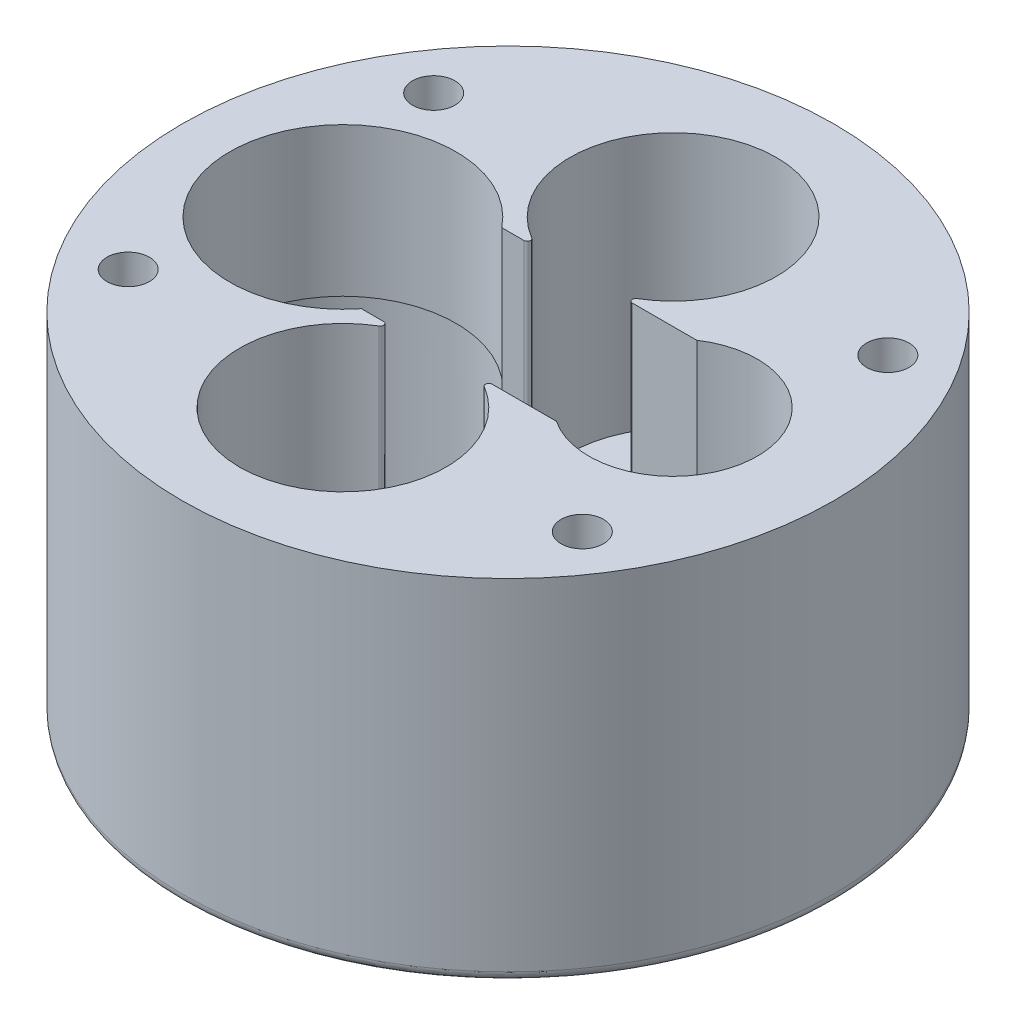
ISO-10303-21;
HEADER;
FILE_DESCRIPTION(('STEP AP214'),'2;1');
FILE_NAME('part.step','',(''),(''),'','','');
FILE_SCHEMA(('AUTOMOTIVE_DESIGN { 1 0 10303 214 1 1 1 1 }'));
ENDSEC;
DATA;
#1=APPLICATION_CONTEXT('core data for automotive mechanical design processes');
#2=APPLICATION_PROTOCOL_DEFINITION('international standard','automotive_design',2000,#1);
#3=PRODUCT_CONTEXT('',#1,'mechanical');
#4=PRODUCT('Part','Part','',(#3));
#5=PRODUCT_RELATED_PRODUCT_CATEGORY('part','',(#4));
#6=PRODUCT_DEFINITION_FORMATION('','',#4);
#7=PRODUCT_DEFINITION_CONTEXT('part definition',#1,'design');
#8=PRODUCT_DEFINITION('design','',#6,#7);
#9=PRODUCT_DEFINITION_SHAPE('','',#8);
#10=(LENGTH_UNIT() NAMED_UNIT(*) SI_UNIT(.MILLI.,.METRE.));
#11=(NAMED_UNIT(*) PLANE_ANGLE_UNIT() SI_UNIT($,.RADIAN.));
#12=(NAMED_UNIT(*) SI_UNIT($,.STERADIAN.) SOLID_ANGLE_UNIT());
#13=UNCERTAINTY_MEASURE_WITH_UNIT(LENGTH_MEASURE(1.E-05),#10,'distance_accuracy_value','');
#14=(GEOMETRIC_REPRESENTATION_CONTEXT(3) GLOBAL_UNCERTAINTY_ASSIGNED_CONTEXT((#13)) GLOBAL_UNIT_ASSIGNED_CONTEXT((#10,
#11,#12)) REPRESENTATION_CONTEXT('',''));
#15=CARTESIAN_POINT('',(0.,0.,0.));
#16=DIRECTION('',(0.,0.,1.));
#17=DIRECTION('',(1.,0.,0.));
#18=AXIS2_PLACEMENT_3D('',#15,#16,#17);
#19=CARTESIAN_POINT('',(-25.4,53.975,0.));
#20=DIRECTION('',(0.,-1.,0.));
#21=DIRECTION('',(0.,0.,-1.));
#22=AXIS2_PLACEMENT_3D('',#19,#20,#21);
#23=CYLINDRICAL_SURFACE('',#22,18.4531);
#24=DIRECTION('',(0.,-1.,0.));
#25=VECTOR('',#24,1.);
#26=CARTESIAN_POINT('',(-10.433875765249,53.975,-10.795));
#27=LINE('',#26,#25);
#28=CARTESIAN_POINT('',(-10.433875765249,31.115,-10.795));
#29=VERTEX_POINT('',#28);
#30=CARTESIAN_POINT('',(-10.433875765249,1.5875,-10.795));
#31=VERTEX_POINT('',#30);
#32=EDGE_CURVE('E60',#29,#31,#27,.T.);
#33=ORIENTED_EDGE('',*,*,#32,.F.);
#34=CARTESIAN_POINT('',(-25.4,31.115,0.));
#35=DIRECTION('',(0.,1.,0.));
#36=DIRECTION('',(0.,0.,1.));
#37=AXIS2_PLACEMENT_3D('',#34,#35,#36);
#38=CIRCLE('',#37,18.4531);
#39=CARTESIAN_POINT('',(-10.433875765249,31.115,10.795));
#40=VERTEX_POINT('',#39);
#41=EDGE_CURVE('E55',#29,#40,#38,.T.);
#42=ORIENTED_EDGE('',*,*,#41,.T.);
#43=DIRECTION('',(0.,-1.,0.));
#44=VECTOR('',#43,1.);
#45=CARTESIAN_POINT('',(-10.433875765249,53.975,10.795));
#46=LINE('',#45,#44);
#47=CARTESIAN_POINT('',(-10.433875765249,1.5875,10.795));
#48=VERTEX_POINT('',#47);
#49=EDGE_CURVE('E292',#40,#48,#46,.T.);
#50=ORIENTED_EDGE('',*,*,#49,.T.);
#51=CARTESIAN_POINT('',(-10.433875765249,1.5875,10.795));
#52=CARTESIAN_POINT('',(-10.4338715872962,1.54910534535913,10.7949925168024));
#53=CARTESIAN_POINT('',(-10.4348803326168,1.51071496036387,10.7963926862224));
#54=CARTESIAN_POINT('',(-10.438891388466,1.4342542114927,10.8019512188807));
#55=CARTESIAN_POINT('',(-10.4418928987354,1.39618372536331,10.806108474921));
#56=CARTESIAN_POINT('',(-10.4498369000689,1.3208359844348,10.8170960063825));
#57=CARTESIAN_POINT('',(-10.4547693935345,1.28355567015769,10.8239125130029));
#58=CARTESIAN_POINT('',(-10.4665119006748,1.20986625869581,10.840107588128));
#59=CARTESIAN_POINT('',(-10.4733220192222,1.17345721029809,10.8494862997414));
#60=CARTESIAN_POINT('',(-10.4964431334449,1.06600196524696,10.8812491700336));
#61=CARTESIAN_POINT('',(-10.5154621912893,0.996566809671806,10.9072842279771));
#62=CARTESIAN_POINT('',(-10.5599442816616,0.863673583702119,10.9677274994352));
#63=CARTESIAN_POINT('',(-10.5854141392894,0.800221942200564,11.0021445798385));
#64=CARTESIAN_POINT('',(-10.6435922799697,0.676757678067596,11.080064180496));
#65=CARTESIAN_POINT('',(-10.6766388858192,0.617168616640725,11.1239828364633));
#66=CARTESIAN_POINT('',(-10.7479319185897,0.506426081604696,11.2177216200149));
#67=CARTESIAN_POINT('',(-10.7861791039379,0.455273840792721,11.26754260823));
#68=CARTESIAN_POINT('',(-10.884612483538,0.341041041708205,11.3942668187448));
#69=CARTESIAN_POINT('',(-10.9470886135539,0.282497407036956,11.4735001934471));
#70=CARTESIAN_POINT('',(-11.0786872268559,0.182441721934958,11.6373548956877));
#71=CARTESIAN_POINT('',(-11.1478337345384,0.14099430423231,11.7219952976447));
#72=CARTESIAN_POINT('',(-11.298491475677,0.0707406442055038,11.9029250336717));
#73=CARTESIAN_POINT('',(-11.3805324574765,0.0437756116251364,11.999487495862));
#74=CARTESIAN_POINT('',(-11.5059141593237,0.0172697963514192,12.1439424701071));
#75=CARTESIAN_POINT('',(-11.5479312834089,0.0107568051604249,12.1918486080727));
#76=CARTESIAN_POINT('',(-11.6326251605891,0.00212761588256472,12.287406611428));
#77=CARTESIAN_POINT('',(-11.6753013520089,7.86182161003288E-06,12.3350586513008));
#78=CARTESIAN_POINT('',(-11.7182386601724,0.,12.3825));
#79=B_SPLINE_CURVE_WITH_KNOTS('',3,(#51,#52,#53,#54,#55,#56,#57,#58,#59,#60,#61,#62,#63,#64,#65,
#66,#67,#68,#69,#70,#71,#72,#73,#74,#75,#76,#77,#78),.UNSPECIFIED.,.F.,.F.,(4,2,2,2,2,2,2,2,2,2,
2,2,2,4),(0.,0.115138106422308,0.230230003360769,0.344733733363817,0.459243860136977,
0.687779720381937,0.916558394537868,1.15883048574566,1.40113794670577,1.74919397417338,
2.09855403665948,2.48552389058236,2.67755944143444,2.8694394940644),.UNSPECIFIED.);
#80=CARTESIAN_POINT('',(-11.7182386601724,0.,12.3825));
#81=VERTEX_POINT('',#80);
#82=EDGE_CURVE('E553',#48,#81,#79,.T.);
#83=ORIENTED_EDGE('',*,*,#82,.T.);
#84=CARTESIAN_POINT('',(-25.4,0.,0.));
#85=DIRECTION('',(0.,1.,0.));
#86=DIRECTION('',(0.,0.,1.));
#87=AXIS2_PLACEMENT_3D('',#84,#85,#86);
#88=CIRCLE('',#87,18.4531);
#89=CARTESIAN_POINT('',(-30.8437166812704,0.,17.6318702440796));
#90=VERTEX_POINT('',#89);
#91=EDGE_CURVE('E359',#90,#81,#88,.T.);
#92=ORIENTED_EDGE('',*,*,#91,.F.);
#93=CARTESIAN_POINT('',(-30.8437166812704,0.,17.6318702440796));
#94=CARTESIAN_POINT('',(-30.9067459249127,3.19286538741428E-06,17.6124104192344));
#95=CARTESIAN_POINT('',(-30.9696682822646,0.000378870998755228,17.5926133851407));
#96=CARTESIAN_POINT('',(-31.0952905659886,0.00163846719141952,17.5523478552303));
#97=CARTESIAN_POINT('',(-31.1579905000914,0.00252236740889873,17.531879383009));
#98=CARTESIAN_POINT('',(-31.3457613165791,0.00558156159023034,17.4694654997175));
#99=CARTESIAN_POINT('',(-31.4704921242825,0.00816426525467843,17.4265150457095));
#100=CARTESIAN_POINT('',(-31.718757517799,0.0129225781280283,17.3380371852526));
#101=CARTESIAN_POINT('',(-31.8422940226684,0.0150990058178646,17.2925152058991));
#102=CARTESIAN_POINT('',(-32.0883714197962,0.0181099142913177,17.1988347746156));
#103=CARTESIAN_POINT('',(-32.2109123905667,0.0189445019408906,17.150676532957));
#104=CARTESIAN_POINT('',(-32.4549354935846,0.0189445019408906,17.0517482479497));
#105=CARTESIAN_POINT('',(-32.5764176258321,0.0181099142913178,17.000978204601));
#106=CARTESIAN_POINT('',(-32.8182606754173,0.0150990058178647,16.8968530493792));
#107=CARTESIAN_POINT('',(-32.9386215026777,0.0129225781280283,16.8434977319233));
#108=CARTESIAN_POINT('',(-33.1784119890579,0.00816426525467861,16.7341151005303));
#109=CARTESIAN_POINT('',(-33.2978392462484,0.00558156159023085,16.678082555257));
#110=CARTESIAN_POINT('',(-33.476063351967,0.00252236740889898,16.5921201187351));
#111=CARTESIAN_POINT('',(-33.5353160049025,0.00163846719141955,16.5631483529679));
#112=CARTESIAN_POINT('',(-33.6535133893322,0.000378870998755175,16.5045680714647));
#113=CARTESIAN_POINT('',(-33.7124581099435,3.19286538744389E-06,16.4749595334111));
#114=CARTESIAN_POINT('',(-33.7712447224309,0.,16.4450345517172));
#115=B_SPLINE_CURVE_WITH_KNOTS('',3,(#93,#94,#95,#96,#97,#98,#99,#100,#101,#102,#103,#104,#105,
#106,#107,#108,#109,#110,#111,#112,#113,#114),.UNSPECIFIED.,.F.,.F.,(4,2,2,2,2,2,2,2,2,2,4),(0.,
0.197888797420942,0.395770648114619,0.79156915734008,1.18656147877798,1.58152234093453,
1.97648320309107,2.37147552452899,2.76727403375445,2.96515588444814,3.16304468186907),.UNSPECIFIED.);
#116=CARTESIAN_POINT('',(-33.7712447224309,0.,16.4450345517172));
#117=VERTEX_POINT('',#116);
#118=EDGE_CURVE('E621',#90,#117,#115,.T.);
#119=ORIENTED_EDGE('',*,*,#118,.T.);
#120=CARTESIAN_POINT('',(-33.7712447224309,0.,-16.4450345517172));
#121=VERTEX_POINT('',#120);
#122=EDGE_CURVE('E380',#121,#117,#88,.T.);
#123=ORIENTED_EDGE('',*,*,#122,.F.);
#124=CARTESIAN_POINT('',(-33.7712447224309,0.,-16.4450345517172));
#125=CARTESIAN_POINT('',(-33.7124581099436,3.1928653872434E-06,-16.474959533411));
#126=CARTESIAN_POINT('',(-33.6535133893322,0.000378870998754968,-16.5045680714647));
#127=CARTESIAN_POINT('',(-33.5353160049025,0.0016384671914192,-16.5631483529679));
#128=CARTESIAN_POINT('',(-33.476063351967,0.00252236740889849,-16.5921201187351));
#129=CARTESIAN_POINT('',(-33.2978392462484,0.00558156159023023,-16.678082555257));
#130=CARTESIAN_POINT('',(-33.178411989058,0.00816426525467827,-16.7341151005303));
#131=CARTESIAN_POINT('',(-32.9386215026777,0.012922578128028,-16.8434977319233));
#132=CARTESIAN_POINT('',(-32.8182606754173,0.0150990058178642,-16.8968530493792));
#133=CARTESIAN_POINT('',(-32.5764176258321,0.0181099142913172,-17.000978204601));
#134=CARTESIAN_POINT('',(-32.4549354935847,0.0189445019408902,-17.0517482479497));
#135=CARTESIAN_POINT('',(-32.2109123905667,0.0189445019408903,-17.150676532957));
#136=CARTESIAN_POINT('',(-32.0883714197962,0.0181099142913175,-17.1988347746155));
#137=CARTESIAN_POINT('',(-31.8422940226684,0.0150990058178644,-17.292515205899));
#138=CARTESIAN_POINT('',(-31.718757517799,0.0129225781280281,-17.3380371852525));
#139=CARTESIAN_POINT('',(-31.4704921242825,0.00816426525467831,-17.4265150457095));
#140=CARTESIAN_POINT('',(-31.3457613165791,0.00558156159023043,-17.4694654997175));
#141=CARTESIAN_POINT('',(-31.1579905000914,0.00252236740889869,-17.5318793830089));
#142=CARTESIAN_POINT('',(-31.0952905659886,0.00163846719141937,-17.5523478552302));
#143=CARTESIAN_POINT('',(-30.9696682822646,0.000378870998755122,-17.5926133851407));
#144=CARTESIAN_POINT('',(-30.9067459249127,3.19286538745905E-06,-17.6124104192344));
#145=CARTESIAN_POINT('',(-30.8437166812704,0.,-17.6318702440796));
#146=B_SPLINE_CURVE_WITH_KNOTS('',3,(#124,#125,#126,#127,#128,#129,#130,#131,#132,#133,#134,
#135,#136,#137,#138,#139,#140,#141,#142,#143,#144,#145),.UNSPECIFIED.,.F.,.F.,(4,2,2,2,2,2,2,2,
2,2,4),(0.,0.197888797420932,0.395770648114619,0.791569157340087,1.186561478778,
1.58152234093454,1.97648320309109,2.37147552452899,2.76727403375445,2.96515588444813,
3.16304468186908),.UNSPECIFIED.);
#147=CARTESIAN_POINT('',(-30.8437166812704,0.,-17.6318702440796));
#148=VERTEX_POINT('',#147);
#149=EDGE_CURVE('E628',#121,#148,#146,.T.);
#150=ORIENTED_EDGE('',*,*,#149,.T.);
#151=CARTESIAN_POINT('',(-11.7182386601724,0.,-12.3825));
#152=VERTEX_POINT('',#151);
#153=EDGE_CURVE('E381',#152,#148,#88,.T.);
#154=ORIENTED_EDGE('',*,*,#153,.F.);
#155=CARTESIAN_POINT('',(-11.7182386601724,0.,-12.3825));
#156=CARTESIAN_POINT('',(-11.6733734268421,9.70506177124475E-06,-12.3329285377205));
#157=CARTESIAN_POINT('',(-11.6287948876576,0.00232316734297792,-12.2831287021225));
#158=CARTESIAN_POINT('',(-11.5403602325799,0.0117506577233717,-12.1832565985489));
#159=CARTESIAN_POINT('',(-11.4965048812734,0.0188694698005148,-12.1331841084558));
#160=CARTESIAN_POINT('',(-11.3657974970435,0.0478468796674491,-11.9823101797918));
#161=CARTESIAN_POINT('',(-11.2804139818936,0.0773319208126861,-11.8815265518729));
#162=CARTESIAN_POINT('',(-11.1292864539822,0.151683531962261,-11.6993744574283));
#163=CARTESIAN_POINT('',(-11.0625866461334,0.193331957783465,-11.6174808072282));
#164=CARTESIAN_POINT('',(-10.9356222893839,0.292883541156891,-11.4590100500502));
#165=CARTESIAN_POINT('',(-10.875337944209,0.350734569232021,-11.382416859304));
#166=CARTESIAN_POINT('',(-10.7738290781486,0.470609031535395,-11.2515580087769));
#167=CARTESIAN_POINT('',(-10.7311555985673,0.529777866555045,-11.1958083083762));
#168=CARTESIAN_POINT('',(-10.6527158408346,0.658882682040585,-11.0922822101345));
#169=CARTESIAN_POINT('',(-10.6169511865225,0.728821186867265,-11.0445076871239));
#170=CARTESIAN_POINT('',(-10.5535981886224,0.879046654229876,-10.9592023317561));
#171=CARTESIAN_POINT('',(-10.526084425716,0.959419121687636,-10.9217651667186));
#172=CARTESIAN_POINT('',(-10.4812236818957,1.12775056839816,-10.8604089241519));
#173=CARTESIAN_POINT('',(-10.4638539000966,1.21569201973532,-10.8364595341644));
#174=CARTESIAN_POINT('',(-10.4460579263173,1.35188860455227,-10.8118737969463));
#175=CARTESIAN_POINT('',(-10.4414998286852,1.39866432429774,-10.8055640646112));
#176=CARTESIAN_POINT('',(-10.4354070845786,1.4927807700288,-10.7971232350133));
#177=CARTESIAN_POINT('',(-10.4338721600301,1.54012144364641,-10.7949917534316));
#178=CARTESIAN_POINT('',(-10.433875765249,1.5875,-10.795));
#179=B_SPLINE_CURVE_WITH_KNOTS('',3,(#155,#156,#157,#158,#159,#160,#161,#162,#163,#164,#165,
#166,#167,#168,#169,#170,#171,#172,#173,#174,#175,#176,#177,#178),.UNSPECIFIED.,.F.,.F.,(4,2,2,
2,2,2,2,2,2,2,2,4),(0.,0.200484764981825,0.401169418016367,0.805240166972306,1.14462243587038,
1.48292509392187,1.75729481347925,2.03172894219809,2.3085737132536,2.58479379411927,
2.72679779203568,2.86878872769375),.UNSPECIFIED.);
#180=EDGE_CURVE('E545',#152,#31,#179,.T.);
#181=ORIENTED_EDGE('',*,*,#180,.T.);
#182=EDGE_LOOP('',(#33,#42,#50,#83,#92,#119,#123,#150,#154,#181));
#183=FACE_BOUND('',#182,.T.);
#184=ADVANCED_FACE('F34',(#183),#23,.F.);
#185=CARTESIAN_POINT('',(0.,0.,0.));
#186=DIRECTION('',(0.,1.,0.));
#187=DIRECTION('',(0.,0.,1.));
#188=AXIS2_PLACEMENT_3D('',#185,#186,#187);
#189=PLANE('',#188);
#190=CARTESIAN_POINT('',(0.,0.,-25.4));
#191=DIRECTION('',(0.,1.,0.));
#192=DIRECTION('',(0.,0.,1.));
#193=AXIS2_PLACEMENT_3D('',#190,#191,#192);
#194=CIRCLE('',#193,8.9281);
#195=CARTESIAN_POINT('',(0.,0.,-16.4719));
#196=VERTEX_POINT('',#195);
#197=EDGE_CURVE('E508',#196,#196,#194,.T.);
#198=ORIENTED_EDGE('',*,*,#197,.T.);
#199=EDGE_LOOP('',(#198));
#200=FACE_BOUND('',#199,.T.);
#201=ORIENTED_EDGE('',*,*,#91,.T.);
#202=DIRECTION('',(1.,0.,0.));
#203=VECTOR('',#202,1.);
#204=CARTESIAN_POINT('',(-3.175,0.,12.3825));
#205=LINE('',#204,#203);
#206=CARTESIAN_POINT('',(-4.7625,0.,12.3825));
#207=VERTEX_POINT('',#206);
#208=EDGE_CURVE('E506',#81,#207,#205,.T.);
#209=ORIENTED_EDGE('',*,*,#208,.T.);
#210=DIRECTION('',(0.,0.,1.));
#211=VECTOR('',#210,1.);
#212=CARTESIAN_POINT('',(-4.7625,0.,0.));
#213=LINE('',#212,#211);
#214=CARTESIAN_POINT('',(-4.76250000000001,0.,25.4));
#215=VERTEX_POINT('',#214);
#216=EDGE_CURVE('E503',#207,#215,#213,.T.);
#217=ORIENTED_EDGE('',*,*,#216,.T.);
#218=CARTESIAN_POINT('',(0.,0.,25.4));
#219=DIRECTION('',(0.,1.,0.));
#220=DIRECTION('',(0.,0.,1.));
#221=AXIS2_PLACEMENT_3D('',#218,#219,#220);
#222=CIRCLE('',#221,4.7625);
#223=CARTESIAN_POINT('',(4.7625,0.,25.4));
#224=VERTEX_POINT('',#223);
#225=EDGE_CURVE('E501',#215,#224,#222,.T.);
#226=ORIENTED_EDGE('',*,*,#225,.T.);
#227=DIRECTION('',(0.,0.,-1.));
#228=VECTOR('',#227,1.);
#229=CARTESIAN_POINT('',(4.7625,0.,0.));
#230=LINE('',#229,#228);
#231=CARTESIAN_POINT('',(4.7625,0.,12.3825));
#232=VERTEX_POINT('',#231);
#233=EDGE_CURVE('E499',#224,#232,#230,.T.);
#234=ORIENTED_EDGE('',*,*,#233,.T.);
#235=DIRECTION('',(1.,0.,0.));
#236=VECTOR('',#235,1.);
#237=CARTESIAN_POINT('',(18.2394070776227,0.,12.3825));
#238=LINE('',#237,#236);
#239=CARTESIAN_POINT('',(18.2394070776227,0.,12.3825));
#240=VERTEX_POINT('',#239);
#241=EDGE_CURVE('E497',#232,#240,#238,.T.);
#242=ORIENTED_EDGE('',*,*,#241,.T.);
#243=CARTESIAN_POINT('',(18.2394070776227,0.,7.62));
#244=DIRECTION('',(0.,1.,0.));
#245=DIRECTION('',(0.,0.,1.));
#246=AXIS2_PLACEMENT_3D('',#243,#244,#245);
#247=CIRCLE('',#246,4.7625);
#248=CARTESIAN_POINT('',(23.0019070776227,0.,7.62));
#249=VERTEX_POINT('',#248);
#250=EDGE_CURVE('E495',#240,#249,#247,.T.);
#251=ORIENTED_EDGE('',*,*,#250,.T.);
#252=DIRECTION('',(0.,0.,-1.));
#253=VECTOR('',#252,1.);
#254=CARTESIAN_POINT('',(23.0019070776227,0.,-7.62));
#255=LINE('',#254,#253);
#256=CARTESIAN_POINT('',(23.0019070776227,0.,-7.62));
#257=VERTEX_POINT('',#256);
#258=EDGE_CURVE('E493',#249,#257,#255,.T.);
#259=ORIENTED_EDGE('',*,*,#258,.T.);
#260=CARTESIAN_POINT('',(18.2394070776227,0.,-7.62));
#261=DIRECTION('',(0.,1.,0.));
#262=DIRECTION('',(0.,0.,1.));
#263=AXIS2_PLACEMENT_3D('',#260,#261,#262);
#264=CIRCLE('',#263,4.7625);
#265=CARTESIAN_POINT('',(18.2394070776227,0.,-12.3825));
#266=VERTEX_POINT('',#265);
#267=EDGE_CURVE('E491',#257,#266,#264,.T.);
#268=ORIENTED_EDGE('',*,*,#267,.T.);
#269=DIRECTION('',(-1.,0.,0.));
#270=VECTOR('',#269,1.);
#271=CARTESIAN_POINT('',(-10.433875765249,0.,-12.3825));
#272=LINE('',#271,#270);
#273=EDGE_CURVE('E489',#266,#152,#272,.T.);
#274=ORIENTED_EDGE('',*,*,#273,.T.);
#275=ORIENTED_EDGE('',*,*,#153,.T.);
#276=CARTESIAN_POINT('',(-34.925,0.,-23.495));
#277=DIRECTION('',(0.,1.,0.));
#278=DIRECTION('',(0.,0.,1.));
#279=AXIS2_PLACEMENT_3D('',#276,#277,#278);
#280=CIRCLE('',#279,7.14375);
#281=CARTESIAN_POINT('',(-38.4217590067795,0.,-29.7244334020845));
#282=VERTEX_POINT('',#281);
#283=EDGE_CURVE('E487',#148,#282,#280,.T.);
#284=ORIENTED_EDGE('',*,*,#283,.T.);
#285=CARTESIAN_POINT('',(0.,0.,0.));
#286=DIRECTION('',(0.,1.,0.));
#287=DIRECTION('',(0.,0.,1.));
#288=AXIS2_PLACEMENT_3D('',#285,#286,#287);
#289=CIRCLE('',#288,48.5775);
#290=CARTESIAN_POINT('',(38.4217590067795,0.,-29.7244334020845));
#291=VERTEX_POINT('',#290);
#292=EDGE_CURVE('E485',#282,#291,#289,.F.);
#293=ORIENTED_EDGE('',*,*,#292,.T.);
#294=CARTESIAN_POINT('',(34.925,0.,-23.495));
#295=DIRECTION('',(0.,1.,0.));
#296=DIRECTION('',(0.,0.,1.));
#297=AXIS2_PLACEMENT_3D('',#294,#295,#296);
#298=CIRCLE('',#297,7.14375);
#299=CARTESIAN_POINT('',(34.925,0.,-30.63875));
#300=VERTEX_POINT('',#299);
#301=EDGE_CURVE('E482',#291,#300,#298,.T.);
#302=ORIENTED_EDGE('',*,*,#301,.T.);
#303=CARTESIAN_POINT('',(34.925,0.,-23.495));
#304=DIRECTION('',(0.,1.,0.));
#305=DIRECTION('',(0.,0.,1.));
#306=AXIS2_PLACEMENT_3D('',#303,#304,#305);
#307=CIRCLE('',#306,7.14375);
#308=CARTESIAN_POINT('',(42.0129442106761,0.,-24.386185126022));
#309=VERTEX_POINT('',#308);
#310=EDGE_CURVE('E480',#300,#309,#307,.T.);
#311=ORIENTED_EDGE('',*,*,#310,.T.);
#312=CARTESIAN_POINT('',(0.,0.,0.));
#313=DIRECTION('',(0.,1.,0.));
#314=DIRECTION('',(0.,0.,1.));
#315=AXIS2_PLACEMENT_3D('',#312,#313,#314);
#316=CIRCLE('',#315,48.5775);
#317=CARTESIAN_POINT('',(42.0129442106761,0.,24.386185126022));
#318=VERTEX_POINT('',#317);
#319=EDGE_CURVE('E478',#309,#318,#316,.F.);
#320=ORIENTED_EDGE('',*,*,#319,.T.);
#321=CARTESIAN_POINT('',(34.925,0.,23.495));
#322=DIRECTION('',(0.,1.,0.));
#323=DIRECTION('',(0.,0.,1.));
#324=AXIS2_PLACEMENT_3D('',#321,#322,#323);
#325=CIRCLE('',#324,7.14375);
#326=CARTESIAN_POINT('',(34.925,0.,16.35125));
#327=VERTEX_POINT('',#326);
#328=EDGE_CURVE('E476',#318,#327,#325,.T.);
#329=ORIENTED_EDGE('',*,*,#328,.T.);
#330=CARTESIAN_POINT('',(34.925,0.,23.495));
#331=DIRECTION('',(0.,1.,0.));
#332=DIRECTION('',(0.,0.,1.));
#333=AXIS2_PLACEMENT_3D('',#330,#331,#332);
#334=CIRCLE('',#333,7.14375);
#335=CARTESIAN_POINT('',(38.4217590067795,0.,29.7244334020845));
#336=VERTEX_POINT('',#335);
#337=EDGE_CURVE('E474',#327,#336,#334,.T.);
#338=ORIENTED_EDGE('',*,*,#337,.T.);
#339=CARTESIAN_POINT('',(0.,0.,0.));
#340=DIRECTION('',(0.,1.,0.));
#341=DIRECTION('',(0.,0.,1.));
#342=AXIS2_PLACEMENT_3D('',#339,#340,#341);
#343=CIRCLE('',#342,48.5775);
#344=CARTESIAN_POINT('',(0.,0.,48.5775));
#345=VERTEX_POINT('',#344);
#346=EDGE_CURVE('E470',#336,#345,#343,.F.);
#347=ORIENTED_EDGE('',*,*,#346,.T.);
#348=CARTESIAN_POINT('',(0.,0.,0.));
#349=DIRECTION('',(0.,1.,0.));
#350=DIRECTION('',(0.,0.,1.));
#351=AXIS2_PLACEMENT_3D('',#348,#349,#350);
#352=CIRCLE('',#351,48.5775);
#353=CARTESIAN_POINT('',(-38.4217590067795,0.,29.7244334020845));
#354=VERTEX_POINT('',#353);
#355=EDGE_CURVE('E468',#345,#354,#352,.F.);
#356=ORIENTED_EDGE('',*,*,#355,.T.);
#357=CARTESIAN_POINT('',(-34.925,0.,23.495));
#358=DIRECTION('',(0.,1.,0.));
#359=DIRECTION('',(0.,0.,1.));
#360=AXIS2_PLACEMENT_3D('',#357,#358,#359);
#361=CIRCLE('',#360,7.14375);
#362=EDGE_CURVE('E472',#354,#90,#361,.T.);
#363=ORIENTED_EDGE('',*,*,#362,.T.);
#364=EDGE_LOOP('',(#201,#209,#217,#226,#234,#242,#251,#259,#268,#274,#275,#284,#293,#302,#311,
#320,#329,#338,#347,#356,#363));
#365=FACE_BOUND('',#364,.T.);
#366=CARTESIAN_POINT('',(25.4,0.,0.));
#367=DIRECTION('',(0.,-1.,0.));
#368=DIRECTION('',(0.,0.,-1.));
#369=AXIS2_PLACEMENT_3D('',#366,#367,#368);
#370=CIRCLE('',#369,1.7272);
#371=CARTESIAN_POINT('',(25.4,0.,-1.7272));
#372=VERTEX_POINT('',#371);
#373=EDGE_CURVE('E318',#372,#372,#370,.T.);
#374=ORIENTED_EDGE('',*,*,#373,.F.);
#375=EDGE_LOOP('',(#374));
#376=FACE_BOUND('',#375,.T.);
#377=ADVANCED_FACE('F693',(#200,#365,#376),#189,.F.);
#378=CARTESIAN_POINT('',(-34.925,53.975,-23.495));
#379=DIRECTION('',(0.,-1.,0.));
#380=DIRECTION('',(0.,0.,-1.));
#381=AXIS2_PLACEMENT_3D('',#378,#379,#380);
#382=CYLINDRICAL_SURFACE('',#381,3.2639);
#383=CARTESIAN_POINT('',(-34.925,53.975,-23.495));
#384=DIRECTION('',(0.,1.,0.));
#385=DIRECTION('',(0.,0.,1.));
#386=AXIS2_PLACEMENT_3D('',#383,#384,#385);
#387=CIRCLE('',#386,3.2639);
#388=CARTESIAN_POINT('',(-34.925,53.975,-20.2311));
#389=VERTEX_POINT('',#388);
#390=EDGE_CURVE('E399',#389,#389,#387,.T.);
#391=ORIENTED_EDGE('',*,*,#390,.T.);
#392=EDGE_LOOP('',(#391));
#393=FACE_BOUND('',#392,.T.);
#394=CARTESIAN_POINT('',(-34.925,12.7,-23.495));
#395=DIRECTION('',(0.,-1.,0.));
#396=DIRECTION('',(0.,0.,-1.));
#397=AXIS2_PLACEMENT_3D('',#394,#395,#396);
#398=CIRCLE('',#397,3.2639);
#399=CARTESIAN_POINT('',(-34.925,12.7,-26.7589));
#400=VERTEX_POINT('',#399);
#401=EDGE_CURVE('E321',#400,#400,#398,.T.);
#402=ORIENTED_EDGE('',*,*,#401,.T.);
#403=EDGE_LOOP('',(#402));
#404=FACE_BOUND('',#403,.T.);
#405=ADVANCED_FACE('F842',(#393,#404),#382,.F.);
#406=CARTESIAN_POINT('',(34.925,53.975,-23.495));
#407=DIRECTION('',(0.,-1.,0.));
#408=DIRECTION('',(0.,0.,-1.));
#409=AXIS2_PLACEMENT_3D('',#406,#407,#408);
#410=CYLINDRICAL_SURFACE('',#409,3.2639);
#411=CARTESIAN_POINT('',(34.925,53.975,-23.495));
#412=DIRECTION('',(0.,1.,0.));
#413=DIRECTION('',(0.,0.,1.));
#414=AXIS2_PLACEMENT_3D('',#411,#412,#413);
#415=CIRCLE('',#414,3.2639);
#416=CARTESIAN_POINT('',(34.925,53.975,-20.2311));
#417=VERTEX_POINT('',#416);
#418=EDGE_CURVE('E396',#417,#417,#415,.T.);
#419=ORIENTED_EDGE('',*,*,#418,.T.);
#420=EDGE_LOOP('',(#419));
#421=FACE_BOUND('',#420,.T.);
#422=CARTESIAN_POINT('',(34.925,12.7,-23.495));
#423=DIRECTION('',(0.,-1.,0.));
#424=DIRECTION('',(0.,0.,-1.));
#425=AXIS2_PLACEMENT_3D('',#422,#423,#424);
#426=CIRCLE('',#425,3.2639);
#427=CARTESIAN_POINT('',(34.925,12.7,-26.7589));
#428=VERTEX_POINT('',#427);
#429=EDGE_CURVE('E420',#428,#428,#426,.T.);
#430=ORIENTED_EDGE('',*,*,#429,.T.);
#431=EDGE_LOOP('',(#430));
#432=FACE_BOUND('',#431,.T.);
#433=ADVANCED_FACE('F848',(#421,#432),#410,.F.);
#434=CARTESIAN_POINT('',(34.925,53.975,23.495));
#435=DIRECTION('',(0.,-1.,0.));
#436=DIRECTION('',(0.,0.,-1.));
#437=AXIS2_PLACEMENT_3D('',#434,#435,#436);
#438=CYLINDRICAL_SURFACE('',#437,3.2639);
#439=CARTESIAN_POINT('',(34.925,53.975,23.495));
#440=DIRECTION('',(0.,1.,0.));
#441=DIRECTION('',(0.,0.,1.));
#442=AXIS2_PLACEMENT_3D('',#439,#440,#441);
#443=CIRCLE('',#442,3.2639);
#444=CARTESIAN_POINT('',(34.925,53.975,26.7589));
#445=VERTEX_POINT('',#444);
#446=EDGE_CURVE('E393',#445,#445,#443,.T.);
#447=ORIENTED_EDGE('',*,*,#446,.T.);
#448=EDGE_LOOP('',(#447));
#449=FACE_BOUND('',#448,.T.);
#450=CARTESIAN_POINT('',(34.925,12.7,23.495));
#451=DIRECTION('',(0.,-1.,0.));
#452=DIRECTION('',(0.,0.,-1.));
#453=AXIS2_PLACEMENT_3D('',#450,#451,#452);
#454=CIRCLE('',#453,3.2639);
#455=CARTESIAN_POINT('',(34.925,12.7,20.2311));
#456=VERTEX_POINT('',#455);
#457=EDGE_CURVE('E417',#456,#456,#454,.T.);
#458=ORIENTED_EDGE('',*,*,#457,.T.);
#459=EDGE_LOOP('',(#458));
#460=FACE_BOUND('',#459,.T.);
#461=ADVANCED_FACE('F870',(#449,#460),#438,.F.);
#462=CARTESIAN_POINT('',(-34.925,53.975,23.495));
#463=DIRECTION('',(0.,-1.,0.));
#464=DIRECTION('',(0.,0.,-1.));
#465=AXIS2_PLACEMENT_3D('',#462,#463,#464);
#466=CYLINDRICAL_SURFACE('',#465,3.2639);
#467=CARTESIAN_POINT('',(-34.925,53.975,23.495));
#468=DIRECTION('',(0.,1.,0.));
#469=DIRECTION('',(0.,0.,1.));
#470=AXIS2_PLACEMENT_3D('',#467,#468,#469);
#471=CIRCLE('',#470,3.2639);
#472=CARTESIAN_POINT('',(-34.925,53.975,26.7589));
#473=VERTEX_POINT('',#472);
#474=EDGE_CURVE('E390',#473,#473,#471,.T.);
#475=ORIENTED_EDGE('',*,*,#474,.T.);
#476=EDGE_LOOP('',(#475));
#477=FACE_BOUND('',#476,.T.);
#478=CARTESIAN_POINT('',(-34.925,12.7,23.495));
#479=DIRECTION('',(0.,-1.,0.));
#480=DIRECTION('',(0.,0.,-1.));
#481=AXIS2_PLACEMENT_3D('',#478,#479,#480);
#482=CIRCLE('',#481,3.2639);
#483=CARTESIAN_POINT('',(-34.925,12.7,20.2311));
#484=VERTEX_POINT('',#483);
#485=EDGE_CURVE('E313',#484,#484,#482,.T.);
#486=ORIENTED_EDGE('',*,*,#485,.T.);
#487=EDGE_LOOP('',(#486));
#488=FACE_BOUND('',#487,.T.);
#489=ADVANCED_FACE('F836',(#477,#488),#466,.F.);
#490=CARTESIAN_POINT('',(25.4,53.975,0.));
#491=DIRECTION('',(0.,-1.,0.));
#492=DIRECTION('',(0.,0.,-1.));
#493=AXIS2_PLACEMENT_3D('',#490,#491,#492);
#494=CYLINDRICAL_SURFACE('',#493,12.954);
#495=DIRECTION('',(0.,-1.,0.));
#496=VECTOR('',#495,1.);
#497=CARTESIAN_POINT('',(18.2394070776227,53.975,-10.795));
#498=LINE('',#497,#496);
#499=CARTESIAN_POINT('',(18.2394070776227,53.975,-10.795));
#500=VERTEX_POINT('',#499);
#501=CARTESIAN_POINT('',(18.2394070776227,6.35,-10.795));
#502=VERTEX_POINT('',#501);
#503=EDGE_CURVE('E383',#500,#502,#498,.T.);
#504=ORIENTED_EDGE('',*,*,#503,.T.);
#505=CARTESIAN_POINT('',(25.4,6.35,0.));
#506=DIRECTION('',(0.,-1.,0.));
#507=DIRECTION('',(0.,0.,-1.));
#508=AXIS2_PLACEMENT_3D('',#505,#506,#507);
#509=CIRCLE('',#508,12.954);
#510=CARTESIAN_POINT('',(18.2394070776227,6.35,10.795));
#511=VERTEX_POINT('',#510);
#512=EDGE_CURVE('E324',#502,#511,#509,.T.);
#513=ORIENTED_EDGE('',*,*,#512,.T.);
#514=DIRECTION('',(0.,-1.,0.));
#515=VECTOR('',#514,1.);
#516=CARTESIAN_POINT('',(18.2394070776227,53.975,10.795));
#517=LINE('',#516,#515);
#518=CARTESIAN_POINT('',(18.2394070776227,53.975,10.795));
#519=VERTEX_POINT('',#518);
#520=EDGE_CURVE('E386',#519,#511,#517,.T.);
#521=ORIENTED_EDGE('',*,*,#520,.F.);
#522=CARTESIAN_POINT('',(25.4,53.975,0.));
#523=DIRECTION('',(0.,1.,0.));
#524=DIRECTION('',(0.,0.,1.));
#525=AXIS2_PLACEMENT_3D('',#522,#523,#524);
#526=CIRCLE('',#525,12.954);
#527=EDGE_CURVE('E370',#519,#500,#526,.T.);
#528=ORIENTED_EDGE('',*,*,#527,.T.);
#529=EDGE_LOOP('',(#504,#513,#521,#528));
#530=FACE_BOUND('',#529,.T.);
#531=ADVANCED_FACE('F790',(#530),#494,.F.);
#532=CARTESIAN_POINT('',(-10.433875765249,53.975,10.795));
#533=DIRECTION('',(0.,0.,-1.));
#534=DIRECTION('',(-1.,0.,0.));
#535=AXIS2_PLACEMENT_3D('',#532,#533,#534);
#536=PLANE('',#535);
#537=DIRECTION('',(0.,-1.,0.));
#538=VECTOR('',#537,1.);
#539=CARTESIAN_POINT('',(18.2394070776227,6.35,10.795));
#540=LINE('',#539,#538);
#541=CARTESIAN_POINT('',(18.2394070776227,1.5875,10.795));
#542=VERTEX_POINT('',#541);
#543=EDGE_CURVE('E341',#511,#542,#540,.T.);
#544=ORIENTED_EDGE('',*,*,#543,.T.);
#545=DIRECTION('',(1.,0.,0.));
#546=VECTOR('',#545,1.);
#547=CARTESIAN_POINT('',(3.175,1.5875,10.795));
#548=LINE('',#547,#546);
#549=CARTESIAN_POINT('',(4.7625,1.5875,10.795));
#550=VERTEX_POINT('',#549);
#551=EDGE_CURVE('E519',#542,#550,#548,.F.);
#552=ORIENTED_EDGE('',*,*,#551,.T.);
#553=DIRECTION('',(0.,-1.,0.));
#554=VECTOR('',#553,1.);
#555=CARTESIAN_POINT('',(4.7625,14.605,10.795));
#556=LINE('',#555,#554);
#557=CARTESIAN_POINT('',(4.7625,14.605,10.795));
#558=VERTEX_POINT('',#557);
#559=EDGE_CURVE('E517',#550,#558,#556,.F.);
#560=ORIENTED_EDGE('',*,*,#559,.T.);
#561=DIRECTION('',(-1.,0.,0.));
#562=VECTOR('',#561,1.);
#563=CARTESIAN_POINT('',(-10.433875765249,14.605,10.795));
#564=LINE('',#563,#562);
#565=CARTESIAN_POINT('',(8.34729177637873,14.605,10.795));
#566=VERTEX_POINT('',#565);
#567=EDGE_CURVE('E408',#566,#558,#564,.T.);
#568=ORIENTED_EDGE('',*,*,#567,.F.);
#569=DIRECTION('',(0.,1.,0.));
#570=VECTOR('',#569,1.);
#571=CARTESIAN_POINT('',(8.34729177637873,53.975,10.795));
#572=LINE('',#571,#570);
#573=CARTESIAN_POINT('',(8.34729177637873,53.975,10.795));
#574=VERTEX_POINT('',#573);
#575=EDGE_CURVE('E449',#566,#574,#572,.T.);
#576=ORIENTED_EDGE('',*,*,#575,.T.);
#577=DIRECTION('',(1.,0.,0.));
#578=VECTOR('',#577,1.);
#579=CARTESIAN_POINT('',(-10.433875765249,53.975,10.795));
#580=LINE('',#579,#578);
#581=EDGE_CURVE('E371',#574,#519,#580,.T.);
#582=ORIENTED_EDGE('',*,*,#581,.T.);
#583=ORIENTED_EDGE('',*,*,#520,.T.);
#584=EDGE_LOOP('',(#544,#552,#560,#568,#576,#582,#583));
#585=FACE_BOUND('',#584,.T.);
#586=ADVANCED_FACE('F830',(#585),#536,.T.);
#587=CARTESIAN_POINT('',(-4.7625,14.605,10.795));
#588=VERTEX_POINT('',#587);
#589=CARTESIAN_POINT('',(-8.34729177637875,14.605,10.795));
#590=VERTEX_POINT('',#589);
#591=EDGE_CURVE('E407',#588,#590,#564,.T.);
#592=ORIENTED_EDGE('',*,*,#591,.F.);
#593=DIRECTION('',(0.,1.,0.));
#594=VECTOR('',#593,1.);
#595=CARTESIAN_POINT('',(-4.7625,0.,10.795));
#596=LINE('',#595,#594);
#597=CARTESIAN_POINT('',(-4.7625,1.5875,10.795));
#598=VERTEX_POINT('',#597);
#599=EDGE_CURVE('E641',#588,#598,#596,.F.);
#600=ORIENTED_EDGE('',*,*,#599,.T.);
#601=DIRECTION('',(1.,0.,0.));
#602=VECTOR('',#601,1.);
#603=CARTESIAN_POINT('',(-10.433875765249,1.5875,10.795));
#604=LINE('',#603,#602);
#605=EDGE_CURVE('E639',#598,#48,#604,.F.);
#606=ORIENTED_EDGE('',*,*,#605,.T.);
#607=ORIENTED_EDGE('',*,*,#49,.F.);
#608=DIRECTION('',(-1.,0.,0.));
#609=VECTOR('',#608,1.);
#610=CARTESIAN_POINT('',(-10.433875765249,31.115,10.795));
#611=LINE('',#610,#609);
#612=CARTESIAN_POINT('',(-11.7547379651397,31.115,10.795));
#613=VERTEX_POINT('',#612);
#614=EDGE_CURVE('E286',#40,#613,#611,.T.);
#615=ORIENTED_EDGE('',*,*,#614,.T.);
#616=DIRECTION('',(0.,1.,0.));
#617=VECTOR('',#616,1.);
#618=CARTESIAN_POINT('',(-11.7547379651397,31.115,10.795));
#619=LINE('',#618,#617);
#620=CARTESIAN_POINT('',(-11.7547379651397,53.975,10.795));
#621=VERTEX_POINT('',#620);
#622=EDGE_CURVE('E269',#613,#621,#619,.T.);
#623=ORIENTED_EDGE('',*,*,#622,.T.);
#624=CARTESIAN_POINT('',(-8.34729177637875,53.975,10.795));
#625=VERTEX_POINT('',#624);
#626=EDGE_CURVE('E368',#621,#625,#580,.T.);
#627=ORIENTED_EDGE('',*,*,#626,.T.);
#628=DIRECTION('',(0.,1.,0.));
#629=VECTOR('',#628,1.);
#630=CARTESIAN_POINT('',(-8.34729177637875,53.975,10.795));
#631=LINE('',#630,#629);
#632=EDGE_CURVE('E442',#625,#590,#631,.F.);
#633=ORIENTED_EDGE('',*,*,#632,.T.);
#634=EDGE_LOOP('',(#592,#600,#606,#607,#615,#623,#627,#633));
#635=FACE_BOUND('',#634,.T.);
#636=ADVANCED_FACE('F290',(#635),#536,.T.);
#637=CARTESIAN_POINT('',(-10.433875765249,53.975,-10.795));
#638=DIRECTION('',(0.,0.,1.));
#639=DIRECTION('',(1.,0.,0.));
#640=AXIS2_PLACEMENT_3D('',#637,#638,#639);
#641=PLANE('',#640);
#642=DIRECTION('',(-1.,0.,0.));
#643=VECTOR('',#642,1.);
#644=CARTESIAN_POINT('',(-10.433875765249,53.975,-10.795));
#645=LINE('',#644,#643);
#646=CARTESIAN_POINT('',(-8.34729177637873,53.975,-10.795));
#647=VERTEX_POINT('',#646);
#648=CARTESIAN_POINT('',(-11.7547379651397,53.975,-10.795));
#649=VERTEX_POINT('',#648);
#650=EDGE_CURVE('E374',#647,#649,#645,.T.);
#651=ORIENTED_EDGE('',*,*,#650,.T.);
#652=DIRECTION('',(0.,1.,0.));
#653=VECTOR('',#652,1.);
#654=CARTESIAN_POINT('',(-11.7547379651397,31.115,-10.795));
#655=LINE('',#654,#653);
#656=CARTESIAN_POINT('',(-11.7547379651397,31.115,-10.795));
#657=VERTEX_POINT('',#656);
#658=EDGE_CURVE('E280',#657,#649,#655,.T.);
#659=ORIENTED_EDGE('',*,*,#658,.F.);
#660=DIRECTION('',(1.,0.,0.));
#661=VECTOR('',#660,1.);
#662=CARTESIAN_POINT('',(-10.433875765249,31.115,-10.795));
#663=LINE('',#662,#661);
#664=EDGE_CURVE('E281',#657,#29,#663,.T.);
#665=ORIENTED_EDGE('',*,*,#664,.T.);
#666=ORIENTED_EDGE('',*,*,#32,.T.);
#667=DIRECTION('',(-1.,0.,0.));
#668=VECTOR('',#667,1.);
#669=CARTESIAN_POINT('',(18.2394070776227,1.5875,-10.795));
#670=LINE('',#669,#668);
#671=CARTESIAN_POINT('',(18.2394070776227,1.5875,-10.795));
#672=VERTEX_POINT('',#671);
#673=EDGE_CURVE('E47',#31,#672,#670,.F.);
#674=ORIENTED_EDGE('',*,*,#673,.T.);
#675=DIRECTION('',(0.,-1.,0.));
#676=VECTOR('',#675,1.);
#677=CARTESIAN_POINT('',(18.2394070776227,6.35,-10.795));
#678=LINE('',#677,#676);
#679=EDGE_CURVE('E333',#502,#672,#678,.T.);
#680=ORIENTED_EDGE('',*,*,#679,.F.);
#681=ORIENTED_EDGE('',*,*,#503,.F.);
#682=CARTESIAN_POINT('',(8.34729177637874,53.975,-10.795));
#683=VERTEX_POINT('',#682);
#684=EDGE_CURVE('E375',#500,#683,#645,.T.);
#685=ORIENTED_EDGE('',*,*,#684,.T.);
#686=DIRECTION('',(0.,1.,0.));
#687=VECTOR('',#686,1.);
#688=CARTESIAN_POINT('',(8.34729177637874,53.975,-10.795));
#689=LINE('',#688,#687);
#690=CARTESIAN_POINT('',(8.34729177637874,14.605,-10.795));
#691=VERTEX_POINT('',#690);
#692=EDGE_CURVE('E414',#683,#691,#689,.F.);
#693=ORIENTED_EDGE('',*,*,#692,.T.);
#694=DIRECTION('',(1.,0.,0.));
#695=VECTOR('',#694,1.);
#696=CARTESIAN_POINT('',(-10.433875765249,14.605,-10.795));
#697=LINE('',#696,#695);
#698=CARTESIAN_POINT('',(-8.34729177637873,14.605,-10.795));
#699=VERTEX_POINT('',#698);
#700=EDGE_CURVE('E405',#699,#691,#697,.T.);
#701=ORIENTED_EDGE('',*,*,#700,.F.);
#702=DIRECTION('',(0.,1.,0.));
#703=VECTOR('',#702,1.);
#704=CARTESIAN_POINT('',(-8.34729177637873,53.975,-10.795));
#705=LINE('',#704,#703);
#706=EDGE_CURVE('E427',#699,#647,#705,.T.);
#707=ORIENTED_EDGE('',*,*,#706,.T.);
#708=EDGE_LOOP('',(#651,#659,#665,#666,#674,#680,#681,#685,#693,#701,#707));
#709=FACE_BOUND('',#708,.T.);
#710=ADVANCED_FACE('F788',(#709),#641,.T.);
#711=CARTESIAN_POINT('',(0.,53.975,0.));
#712=DIRECTION('',(0.,1.,0.));
#713=DIRECTION('',(0.,0.,1.));
#714=AXIS2_PLACEMENT_3D('',#711,#712,#713);
#715=PLANE('',#714);
#716=ORIENTED_EDGE('',*,*,#446,.F.);
#717=EDGE_LOOP('',(#716));
#718=FACE_BOUND('',#717,.T.);
#719=ORIENTED_EDGE('',*,*,#390,.F.);
#720=EDGE_LOOP('',(#719));
#721=FACE_BOUND('',#720,.T.);
#722=CARTESIAN_POINT('',(0.,53.975,0.));
#723=DIRECTION('',(0.,1.,0.));
#724=DIRECTION('',(0.,0.,1.));
#725=AXIS2_PLACEMENT_3D('',#722,#723,#724);
#726=CIRCLE('',#725,50.165);
#727=CARTESIAN_POINT('',(0.,53.975,50.165));
#728=VERTEX_POINT('',#727);
#729=EDGE_CURVE('E402',#728,#728,#726,.T.);
#730=ORIENTED_EDGE('',*,*,#729,.T.);
#731=EDGE_LOOP('',(#730));
#732=FACE_BOUND('',#731,.T.);
#733=ORIENTED_EDGE('',*,*,#418,.F.);
#734=EDGE_LOOP('',(#733));
#735=FACE_BOUND('',#734,.T.);
#736=ORIENTED_EDGE('',*,*,#474,.F.);
#737=EDGE_LOOP('',(#736));
#738=FACE_BOUND('',#737,.T.);
#739=ORIENTED_EDGE('',*,*,#650,.F.);
#740=CARTESIAN_POINT('',(-8.34729177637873,53.975,-11.303));
#741=DIRECTION('',(0.,1.,0.));
#742=DIRECTION('',(0.,0.,1.));
#743=AXIS2_PLACEMENT_3D('',#740,#741,#742);
#744=CIRCLE('',#743,0.508);
#745=CARTESIAN_POINT('',(-8.0884610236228,53.975,-11.7401162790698));
#746=VERTEX_POINT('',#745);
#747=EDGE_CURVE('E436',#647,#746,#744,.T.);
#748=ORIENTED_EDGE('',*,*,#747,.T.);
#749=CARTESIAN_POINT('',(0.,53.975,-25.4));
#750=DIRECTION('',(0.,-1.,0.));
#751=DIRECTION('',(0.,0.,-1.));
#752=AXIS2_PLACEMENT_3D('',#749,#750,#751);
#753=CIRCLE('',#752,15.875);
#754=CARTESIAN_POINT('',(8.08846102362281,53.975,-11.7401162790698));
#755=VERTEX_POINT('',#754);
#756=EDGE_CURVE('E354',#746,#755,#753,.T.);
#757=ORIENTED_EDGE('',*,*,#756,.T.);
#758=CARTESIAN_POINT('',(8.34729177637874,53.975,-11.303));
#759=DIRECTION('',(0.,1.,0.));
#760=DIRECTION('',(0.,0.,1.));
#761=AXIS2_PLACEMENT_3D('',#758,#759,#760);
#762=CIRCLE('',#761,0.508);
#763=EDGE_CURVE('E430',#755,#683,#762,.T.);
#764=ORIENTED_EDGE('',*,*,#763,.T.);
#765=ORIENTED_EDGE('',*,*,#684,.F.);
#766=ORIENTED_EDGE('',*,*,#527,.F.);
#767=ORIENTED_EDGE('',*,*,#581,.F.);
#768=CARTESIAN_POINT('',(8.34729177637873,53.975,11.303));
#769=DIRECTION('',(0.,1.,0.));
#770=DIRECTION('',(0.,0.,1.));
#771=AXIS2_PLACEMENT_3D('',#768,#769,#770);
#772=CIRCLE('',#771,0.508);
#773=CARTESIAN_POINT('',(8.0884610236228,53.975,11.7401162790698));
#774=VERTEX_POINT('',#773);
#775=EDGE_CURVE('E432',#574,#774,#772,.T.);
#776=ORIENTED_EDGE('',*,*,#775,.T.);
#777=CARTESIAN_POINT('',(0.,53.975,25.4));
#778=DIRECTION('',(0.,-1.,0.));
#779=DIRECTION('',(0.,0.,-1.));
#780=AXIS2_PLACEMENT_3D('',#777,#778,#779);
#781=CIRCLE('',#780,15.875);
#782=CARTESIAN_POINT('',(-8.08846102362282,53.975,11.7401162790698));
#783=VERTEX_POINT('',#782);
#784=EDGE_CURVE('E360',#774,#783,#781,.T.);
#785=ORIENTED_EDGE('',*,*,#784,.T.);
#786=CARTESIAN_POINT('',(-8.34729177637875,53.975,11.303));
#787=DIRECTION('',(0.,1.,0.));
#788=DIRECTION('',(0.,0.,1.));
#789=AXIS2_PLACEMENT_3D('',#786,#787,#788);
#790=CIRCLE('',#789,0.508);
#791=EDGE_CURVE('E434',#783,#625,#790,.T.);
#792=ORIENTED_EDGE('',*,*,#791,.T.);
#793=ORIENTED_EDGE('',*,*,#626,.F.);
#794=CARTESIAN_POINT('',(-25.4,53.975,0.));
#795=DIRECTION('',(0.,-1.,0.));
#796=DIRECTION('',(0.,0.,1.));
#797=AXIS2_PLACEMENT_3D('',#794,#795,#796);
#798=CIRCLE('',#797,17.399);
#799=EDGE_CURVE('E276',#621,#649,#798,.T.);
#800=ORIENTED_EDGE('',*,*,#799,.T.);
#801=EDGE_LOOP('',(#739,#748,#757,#764,#765,#766,#767,#776,#785,#792,#793,#800));
#802=FACE_BOUND('',#801,.T.);
#803=ADVANCED_FACE('F797',(#718,#721,#732,#735,#738,#802),#715,.T.);
#804=ORIENTED_EDGE('',*,*,#122,.T.);
#805=CARTESIAN_POINT('',(-34.925,0.,23.495));
#806=DIRECTION('',(0.,1.,0.));
#807=DIRECTION('',(0.,0.,1.));
#808=AXIS2_PLACEMENT_3D('',#805,#806,#807);
#809=CIRCLE('',#808,7.14375);
#810=CARTESIAN_POINT('',(-42.0129442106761,0.,24.386185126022));
#811=VERTEX_POINT('',#810);
#812=EDGE_CURVE('E466',#117,#811,#809,.T.);
#813=ORIENTED_EDGE('',*,*,#812,.T.);
#814=CARTESIAN_POINT('',(0.,0.,0.));
#815=DIRECTION('',(0.,1.,0.));
#816=DIRECTION('',(0.,0.,1.));
#817=AXIS2_PLACEMENT_3D('',#814,#815,#816);
#818=CIRCLE('',#817,48.5775);
#819=CARTESIAN_POINT('',(-42.0129442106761,0.,-24.386185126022));
#820=VERTEX_POINT('',#819);
#821=EDGE_CURVE('E462',#811,#820,#818,.F.);
#822=ORIENTED_EDGE('',*,*,#821,.T.);
#823=CARTESIAN_POINT('',(-34.925,0.,-23.495));
#824=DIRECTION('',(0.,1.,0.));
#825=DIRECTION('',(0.,0.,1.));
#826=AXIS2_PLACEMENT_3D('',#823,#824,#825);
#827=CIRCLE('',#826,7.14375);
#828=EDGE_CURVE('E464',#820,#121,#827,.T.);
#829=ORIENTED_EDGE('',*,*,#828,.T.);
#830=EDGE_LOOP('',(#804,#813,#822,#829));
#831=FACE_BOUND('',#830,.T.);
#832=ADVANCED_FACE('F701',(#831),#189,.F.);
#833=CARTESIAN_POINT('',(0.,53.975,0.));
#834=DIRECTION('',(0.,-1.,0.));
#835=DIRECTION('',(0.,0.,-1.));
#836=AXIS2_PLACEMENT_3D('',#833,#834,#835);
#837=CYLINDRICAL_SURFACE('',#836,50.165);
#838=CARTESIAN_POINT('',(0.,1.5875,0.));
#839=DIRECTION('',(0.,1.,0.));
#840=DIRECTION('',(0.,0.,1.));
#841=AXIS2_PLACEMENT_3D('',#838,#839,#840);
#842=CIRCLE('',#841,50.165);
#843=CARTESIAN_POINT('',(0.,1.5875,50.165));
#844=VERTEX_POINT('',#843);
#845=EDGE_CURVE('E11',#844,#844,#842,.T.);
#846=ORIENTED_EDGE('',*,*,#845,.T.);
#847=EDGE_LOOP('',(#846));
#848=FACE_BOUND('',#847,.T.);
#849=ORIENTED_EDGE('',*,*,#729,.F.);
#850=EDGE_LOOP('',(#849));
#851=FACE_BOUND('',#850,.T.);
#852=ADVANCED_FACE('F854',(#848,#851),#837,.T.);
#853=CARTESIAN_POINT('',(0.,14.605,-25.4));
#854=DIRECTION('',(0.,1.,0.));
#855=DIRECTION('',(0.,0.,1.));
#856=AXIS2_PLACEMENT_3D('',#853,#854,#855);
#857=CYLINDRICAL_SURFACE('',#856,15.875);
#858=ORIENTED_EDGE('',*,*,#756,.F.);
#859=DIRECTION('',(0.,1.,0.));
#860=VECTOR('',#859,1.);
#861=CARTESIAN_POINT('',(-8.0884610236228,14.605,-11.7401162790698));
#862=LINE('',#861,#860);
#863=CARTESIAN_POINT('',(-8.0884610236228,14.605,-11.7401162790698));
#864=VERTEX_POINT('',#863);
#865=EDGE_CURVE('E440',#746,#864,#862,.F.);
#866=ORIENTED_EDGE('',*,*,#865,.T.);
#867=CARTESIAN_POINT('',(0.,14.605,-25.4));
#868=DIRECTION('',(0.,-1.,0.));
#869=DIRECTION('',(0.,0.,-1.));
#870=AXIS2_PLACEMENT_3D('',#867,#868,#869);
#871=CIRCLE('',#870,15.875);
#872=CARTESIAN_POINT('',(8.08846102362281,14.605,-11.7401162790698));
#873=VERTEX_POINT('',#872);
#874=EDGE_CURVE('E363',#864,#873,#871,.T.);
#875=ORIENTED_EDGE('',*,*,#874,.T.);
#876=DIRECTION('',(0.,1.,0.));
#877=VECTOR('',#876,1.);
#878=CARTESIAN_POINT('',(8.08846102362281,14.605,-11.7401162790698));
#879=LINE('',#878,#877);
#880=EDGE_CURVE('E438',#873,#755,#879,.T.);
#881=ORIENTED_EDGE('',*,*,#880,.T.);
#882=EDGE_LOOP('',(#858,#866,#875,#881));
#883=FACE_BOUND('',#882,.T.);
#884=ADVANCED_FACE('F809',(#883),#857,.F.);
#885=CARTESIAN_POINT('',(0.,14.605,-25.4));
#886=DIRECTION('',(0.,-1.,0.));
#887=DIRECTION('',(0.,0.,-1.));
#888=AXIS2_PLACEMENT_3D('',#885,#886,#887);
#889=PLANE('',#888);
#890=CARTESIAN_POINT('',(0.,14.605,-25.4));
#891=DIRECTION('',(0.,-1.,0.));
#892=DIRECTION('',(0.,0.,-1.));
#893=AXIS2_PLACEMENT_3D('',#890,#891,#892);
#894=CIRCLE('',#893,8.9281);
#895=CARTESIAN_POINT('',(0.,14.605,-34.3281));
#896=VERTEX_POINT('',#895);
#897=EDGE_CURVE('E533',#896,#896,#894,.T.);
#898=ORIENTED_EDGE('',*,*,#897,.T.);
#899=EDGE_LOOP('',(#898));
#900=FACE_BOUND('',#899,.T.);
#901=ORIENTED_EDGE('',*,*,#700,.T.);
#902=CARTESIAN_POINT('',(8.34729177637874,14.605,-11.303));
#903=DIRECTION('',(0.,-1.,0.));
#904=DIRECTION('',(0.,0.,-1.));
#905=AXIS2_PLACEMENT_3D('',#902,#903,#904);
#906=CIRCLE('',#905,0.508);
#907=EDGE_CURVE('E460',#691,#873,#906,.T.);
#908=ORIENTED_EDGE('',*,*,#907,.T.);
#909=ORIENTED_EDGE('',*,*,#874,.F.);
#910=CARTESIAN_POINT('',(-8.34729177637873,14.605,-11.303));
#911=DIRECTION('',(0.,-1.,0.));
#912=DIRECTION('',(0.,0.,-1.));
#913=AXIS2_PLACEMENT_3D('',#910,#911,#912);
#914=CIRCLE('',#913,0.508);
#915=EDGE_CURVE('E452',#864,#699,#914,.T.);
#916=ORIENTED_EDGE('',*,*,#915,.T.);
#917=EDGE_LOOP('',(#901,#908,#909,#916));
#918=FACE_BOUND('',#917,.T.);
#919=ADVANCED_FACE('F805',(#900,#918),#889,.F.);
#920=CARTESIAN_POINT('',(0.,14.605,25.4));
#921=DIRECTION('',(0.,1.,0.));
#922=DIRECTION('',(0.,0.,1.));
#923=AXIS2_PLACEMENT_3D('',#920,#921,#922);
#924=CYLINDRICAL_SURFACE('',#923,15.875);
#925=CARTESIAN_POINT('',(0.,14.605,25.4));
#926=DIRECTION('',(0.,-1.,0.));
#927=DIRECTION('',(0.,0.,-1.));
#928=AXIS2_PLACEMENT_3D('',#925,#926,#927);
#929=CIRCLE('',#928,15.875);
#930=CARTESIAN_POINT('',(8.0884610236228,14.605,11.7401162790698));
#931=VERTEX_POINT('',#930);
#932=CARTESIAN_POINT('',(-8.08846102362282,14.605,11.7401162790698));
#933=VERTEX_POINT('',#932);
#934=EDGE_CURVE('E356',#931,#933,#929,.T.);
#935=ORIENTED_EDGE('',*,*,#934,.T.);
#936=DIRECTION('',(0.,1.,0.));
#937=VECTOR('',#936,1.);
#938=CARTESIAN_POINT('',(-8.08846102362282,14.605,11.7401162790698));
#939=LINE('',#938,#937);
#940=EDGE_CURVE('E447',#933,#783,#939,.T.);
#941=ORIENTED_EDGE('',*,*,#940,.T.);
#942=ORIENTED_EDGE('',*,*,#784,.F.);
#943=DIRECTION('',(0.,1.,0.));
#944=VECTOR('',#943,1.);
#945=CARTESIAN_POINT('',(8.0884610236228,14.605,11.7401162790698));
#946=LINE('',#945,#944);
#947=EDGE_CURVE('E445',#774,#931,#946,.F.);
#948=ORIENTED_EDGE('',*,*,#947,.T.);
#949=EDGE_LOOP('',(#935,#941,#942,#948));
#950=FACE_BOUND('',#949,.T.);
#951=ADVANCED_FACE('F823',(#950),#924,.F.);
#952=CARTESIAN_POINT('',(0.,14.605,25.4));
#953=DIRECTION('',(0.,-1.,0.));
#954=DIRECTION('',(0.,0.,-1.));
#955=AXIS2_PLACEMENT_3D('',#952,#953,#954);
#956=PLANE('',#955);
#957=DIRECTION('',(0.,0.,-1.));
#958=VECTOR('',#957,1.);
#959=CARTESIAN_POINT('',(-3.175,14.605,25.4));
#960=LINE('',#959,#958);
#961=CARTESIAN_POINT('',(-3.17500000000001,14.605,25.4));
#962=VERTEX_POINT('',#961);
#963=CARTESIAN_POINT('',(-3.175,14.605,12.3825));
#964=VERTEX_POINT('',#963);
#965=EDGE_CURVE('E411',#962,#964,#960,.T.);
#966=ORIENTED_EDGE('',*,*,#965,.T.);
#967=CARTESIAN_POINT('',(-4.7625,14.605,12.3825));
#968=DIRECTION('',(0.,-1.,0.));
#969=DIRECTION('',(0.,0.,-1.));
#970=AXIS2_PLACEMENT_3D('',#967,#968,#969);
#971=CIRCLE('',#970,1.5875);
#972=EDGE_CURVE('E637',#964,#588,#971,.F.);
#973=ORIENTED_EDGE('',*,*,#972,.T.);
#974=ORIENTED_EDGE('',*,*,#591,.T.);
#975=CARTESIAN_POINT('',(-8.34729177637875,14.605,11.303));
#976=DIRECTION('',(0.,-1.,0.));
#977=DIRECTION('',(0.,0.,-1.));
#978=AXIS2_PLACEMENT_3D('',#975,#976,#977);
#979=CIRCLE('',#978,0.508);
#980=EDGE_CURVE('E455',#590,#933,#979,.T.);
#981=ORIENTED_EDGE('',*,*,#980,.T.);
#982=ORIENTED_EDGE('',*,*,#934,.F.);
#983=CARTESIAN_POINT('',(8.34729177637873,14.605,11.303));
#984=DIRECTION('',(0.,-1.,0.));
#985=DIRECTION('',(0.,0.,-1.));
#986=AXIS2_PLACEMENT_3D('',#983,#984,#985);
#987=CIRCLE('',#986,0.508);
#988=EDGE_CURVE('E457',#931,#566,#987,.T.);
#989=ORIENTED_EDGE('',*,*,#988,.T.);
#990=ORIENTED_EDGE('',*,*,#567,.T.);
#991=CARTESIAN_POINT('',(4.7625,14.605,12.3825));
#992=DIRECTION('',(0.,-1.,0.));
#993=DIRECTION('',(0.,0.,-1.));
#994=AXIS2_PLACEMENT_3D('',#991,#992,#993);
#995=CIRCLE('',#994,1.5875);
#996=CARTESIAN_POINT('',(3.175,14.605,12.3825));
#997=VERTEX_POINT('',#996);
#998=EDGE_CURVE('E635',#558,#997,#995,.F.);
#999=ORIENTED_EDGE('',*,*,#998,.T.);
#1000=DIRECTION('',(0.,0.,-1.));
#1001=VECTOR('',#1000,1.);
#1002=CARTESIAN_POINT('',(3.175,14.605,0.));
#1003=LINE('',#1002,#1001);
#1004=CARTESIAN_POINT('',(3.175,14.605,25.4));
#1005=VERTEX_POINT('',#1004);
#1006=EDGE_CURVE('E348',#1005,#997,#1003,.T.);
#1007=ORIENTED_EDGE('',*,*,#1006,.F.);
#1008=CARTESIAN_POINT('',(0.,14.605,25.4));
#1009=DIRECTION('',(0.,1.,0.));
#1010=DIRECTION('',(0.,0.,1.));
#1011=AXIS2_PLACEMENT_3D('',#1008,#1009,#1010);
#1012=CIRCLE('',#1011,3.175);
#1013=EDGE_CURVE('E337',#962,#1005,#1012,.T.);
#1014=ORIENTED_EDGE('',*,*,#1013,.F.);
#1015=EDGE_LOOP('',(#966,#973,#974,#981,#982,#989,#990,#999,#1007,#1014));
#1016=FACE_BOUND('',#1015,.T.);
#1017=ADVANCED_FACE('F753',(#1016),#956,.F.);
#1018=CARTESIAN_POINT('',(3.175,0.,0.));
#1019=DIRECTION('',(1.,0.,0.));
#1020=DIRECTION('',(0.,0.,-1.));
#1021=AXIS2_PLACEMENT_3D('',#1018,#1019,#1020);
#1022=PLANE('',#1021);
#1023=ORIENTED_EDGE('',*,*,#1006,.T.);
#1024=DIRECTION('',(0.,-1.,0.));
#1025=VECTOR('',#1024,1.);
#1026=CARTESIAN_POINT('',(3.175,0.,12.3825));
#1027=LINE('',#1026,#1025);
#1028=CARTESIAN_POINT('',(3.175,1.5875,12.3825));
#1029=VERTEX_POINT('',#1028);
#1030=EDGE_CURVE('E645',#997,#1029,#1027,.T.);
#1031=ORIENTED_EDGE('',*,*,#1030,.T.);
#1032=DIRECTION('',(0.,0.,-1.));
#1033=VECTOR('',#1032,1.);
#1034=CARTESIAN_POINT('',(3.175,1.5875,0.));
#1035=LINE('',#1034,#1033);
#1036=CARTESIAN_POINT('',(3.175,1.5875,25.4));
#1037=VERTEX_POINT('',#1036);
#1038=EDGE_CURVE('E643',#1029,#1037,#1035,.F.);
#1039=ORIENTED_EDGE('',*,*,#1038,.T.);
#1040=DIRECTION('',(0.,1.,0.));
#1041=VECTOR('',#1040,1.);
#1042=CARTESIAN_POINT('',(3.175,0.,25.4));
#1043=LINE('',#1042,#1041);
#1044=EDGE_CURVE('E352',#1037,#1005,#1043,.T.);
#1045=ORIENTED_EDGE('',*,*,#1044,.T.);
#1046=EDGE_LOOP('',(#1023,#1031,#1039,#1045));
#1047=FACE_BOUND('',#1046,.T.);
#1048=ADVANCED_FACE('F757',(#1047),#1022,.F.);
#1049=CARTESIAN_POINT('',(0.,0.,25.4));
#1050=DIRECTION('',(0.,1.,0.));
#1051=DIRECTION('',(0.,0.,1.));
#1052=AXIS2_PLACEMENT_3D('',#1049,#1050,#1051);
#1053=CYLINDRICAL_SURFACE('',#1052,3.175);
#1054=ORIENTED_EDGE('',*,*,#1044,.F.);
#1055=CARTESIAN_POINT('',(0.,1.5875,25.4));
#1056=DIRECTION('',(0.,1.,0.));
#1057=DIRECTION('',(0.,0.,1.));
#1058=AXIS2_PLACEMENT_3D('',#1055,#1056,#1057);
#1059=CIRCLE('',#1058,3.175);
#1060=CARTESIAN_POINT('',(-3.17500000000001,1.5875,25.4));
#1061=VERTEX_POINT('',#1060);
#1062=EDGE_CURVE('E515',#1037,#1061,#1059,.F.);
#1063=ORIENTED_EDGE('',*,*,#1062,.T.);
#1064=DIRECTION('',(0.,1.,0.));
#1065=VECTOR('',#1064,1.);
#1066=CARTESIAN_POINT('',(-3.17500000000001,0.,25.4));
#1067=LINE('',#1066,#1065);
#1068=EDGE_CURVE('E351',#1061,#962,#1067,.T.);
#1069=ORIENTED_EDGE('',*,*,#1068,.T.);
#1070=ORIENTED_EDGE('',*,*,#1013,.T.);
#1071=EDGE_LOOP('',(#1054,#1063,#1069,#1070));
#1072=FACE_BOUND('',#1071,.T.);
#1073=ADVANCED_FACE('F744',(#1072),#1053,.F.);
#1074=CARTESIAN_POINT('',(-3.175,0.,0.));
#1075=DIRECTION('',(-1.,0.,0.));
#1076=DIRECTION('',(0.,0.,1.));
#1077=AXIS2_PLACEMENT_3D('',#1074,#1075,#1076);
#1078=PLANE('',#1077);
#1079=ORIENTED_EDGE('',*,*,#1068,.F.);
#1080=DIRECTION('',(0.,0.,1.));
#1081=VECTOR('',#1080,1.);
#1082=CARTESIAN_POINT('',(-3.175,1.5875,0.));
#1083=LINE('',#1082,#1081);
#1084=CARTESIAN_POINT('',(-3.175,1.5875,12.3825));
#1085=VERTEX_POINT('',#1084);
#1086=EDGE_CURVE('E513',#1061,#1085,#1083,.F.);
#1087=ORIENTED_EDGE('',*,*,#1086,.T.);
#1088=DIRECTION('',(0.,1.,0.));
#1089=VECTOR('',#1088,1.);
#1090=CARTESIAN_POINT('',(-3.175,14.605,12.3825));
#1091=LINE('',#1090,#1089);
#1092=EDGE_CURVE('E511',#1085,#964,#1091,.T.);
#1093=ORIENTED_EDGE('',*,*,#1092,.T.);
#1094=ORIENTED_EDGE('',*,*,#965,.F.);
#1095=EDGE_LOOP('',(#1079,#1087,#1093,#1094));
#1096=FACE_BOUND('',#1095,.T.);
#1097=ADVANCED_FACE('F747',(#1096),#1078,.F.);
#1098=CARTESIAN_POINT('',(0.,0.,-25.4));
#1099=DIRECTION('',(0.,1.,0.));
#1100=DIRECTION('',(0.,0.,1.));
#1101=AXIS2_PLACEMENT_3D('',#1098,#1099,#1100);
#1102=CYLINDRICAL_SURFACE('',#1101,7.3406);
#1103=CARTESIAN_POINT('',(0.,13.0175,-25.4));
#1104=DIRECTION('',(0.,-1.,0.));
#1105=DIRECTION('',(0.,0.,-1.));
#1106=AXIS2_PLACEMENT_3D('',#1103,#1104,#1105);
#1107=CIRCLE('',#1106,7.3406);
#1108=CARTESIAN_POINT('',(0.,13.0175,-32.7406));
#1109=VERTEX_POINT('',#1108);
#1110=EDGE_CURVE('E530',#1109,#1109,#1107,.F.);
#1111=ORIENTED_EDGE('',*,*,#1110,.T.);
#1112=EDGE_LOOP('',(#1111));
#1113=FACE_BOUND('',#1112,.T.);
#1114=CARTESIAN_POINT('',(0.,1.5875,-25.4));
#1115=DIRECTION('',(0.,1.,0.));
#1116=DIRECTION('',(0.,0.,1.));
#1117=AXIS2_PLACEMENT_3D('',#1114,#1115,#1116);
#1118=CIRCLE('',#1117,7.3406);
#1119=CARTESIAN_POINT('',(0.,1.5875,-18.0594));
#1120=VERTEX_POINT('',#1119);
#1121=EDGE_CURVE('E527',#1120,#1120,#1118,.F.);
#1122=ORIENTED_EDGE('',*,*,#1121,.T.);
#1123=EDGE_LOOP('',(#1122));
#1124=FACE_BOUND('',#1123,.T.);
#1125=ADVANCED_FACE('F933',(#1113,#1124),#1102,.F.);
#1126=CARTESIAN_POINT('',(18.2394070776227,6.35,-7.62));
#1127=DIRECTION('',(0.,-1.,0.));
#1128=DIRECTION('',(0.,0.,-1.));
#1129=AXIS2_PLACEMENT_3D('',#1126,#1127,#1128);
#1130=CYLINDRICAL_SURFACE('',#1129,3.175);
#1131=ORIENTED_EDGE('',*,*,#679,.T.);
#1132=CARTESIAN_POINT('',(18.2394070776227,1.5875,-7.62));
#1133=DIRECTION('',(0.,1.,0.));
#1134=DIRECTION('',(0.,0.,1.));
#1135=AXIS2_PLACEMENT_3D('',#1132,#1133,#1134);
#1136=CIRCLE('',#1135,3.175);
#1137=CARTESIAN_POINT('',(21.4144070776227,1.5875,-7.62));
#1138=VERTEX_POINT('',#1137);
#1139=EDGE_CURVE('E525',#672,#1138,#1136,.F.);
#1140=ORIENTED_EDGE('',*,*,#1139,.T.);
#1141=DIRECTION('',(0.,-1.,0.));
#1142=VECTOR('',#1141,1.);
#1143=CARTESIAN_POINT('',(21.4144070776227,6.35,-7.62));
#1144=LINE('',#1143,#1142);
#1145=CARTESIAN_POINT('',(21.4144070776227,6.35,-7.62));
#1146=VERTEX_POINT('',#1145);
#1147=EDGE_CURVE('E334',#1146,#1138,#1144,.T.);
#1148=ORIENTED_EDGE('',*,*,#1147,.F.);
#1149=CARTESIAN_POINT('',(18.2394070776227,6.35,-7.62));
#1150=DIRECTION('',(0.,1.,0.));
#1151=DIRECTION('',(0.,0.,-1.));
#1152=AXIS2_PLACEMENT_3D('',#1149,#1150,#1151);
#1153=CIRCLE('',#1152,3.175);
#1154=EDGE_CURVE('E317',#1146,#502,#1153,.T.);
#1155=ORIENTED_EDGE('',*,*,#1154,.T.);
#1156=EDGE_LOOP('',(#1131,#1140,#1148,#1155));
#1157=FACE_BOUND('',#1156,.T.);
#1158=ADVANCED_FACE('F786',(#1157),#1130,.F.);
#1159=CARTESIAN_POINT('',(21.4144070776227,6.35,7.62));
#1160=DIRECTION('',(-1.,0.,0.));
#1161=DIRECTION('',(0.,0.,1.));
#1162=AXIS2_PLACEMENT_3D('',#1159,#1160,#1161);
#1163=PLANE('',#1162);
#1164=ORIENTED_EDGE('',*,*,#1147,.T.);
#1165=DIRECTION('',(0.,0.,-1.));
#1166=VECTOR('',#1165,1.);
#1167=CARTESIAN_POINT('',(21.4144070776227,1.5875,7.62));
#1168=LINE('',#1167,#1166);
#1169=CARTESIAN_POINT('',(21.4144070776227,1.5875,7.62));
#1170=VERTEX_POINT('',#1169);
#1171=EDGE_CURVE('E523',#1138,#1170,#1168,.F.);
#1172=ORIENTED_EDGE('',*,*,#1171,.T.);
#1173=DIRECTION('',(0.,-1.,0.));
#1174=VECTOR('',#1173,1.);
#1175=CARTESIAN_POINT('',(21.4144070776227,6.35,7.62));
#1176=LINE('',#1175,#1174);
#1177=CARTESIAN_POINT('',(21.4144070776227,6.35,7.62));
#1178=VERTEX_POINT('',#1177);
#1179=EDGE_CURVE('E338',#1178,#1170,#1176,.T.);
#1180=ORIENTED_EDGE('',*,*,#1179,.F.);
#1181=DIRECTION('',(0.,0.,-1.));
#1182=VECTOR('',#1181,1.);
#1183=CARTESIAN_POINT('',(21.4144070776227,6.35,7.62));
#1184=LINE('',#1183,#1182);
#1185=EDGE_CURVE('E330',#1178,#1146,#1184,.T.);
#1186=ORIENTED_EDGE('',*,*,#1185,.T.);
#1187=EDGE_LOOP('',(#1164,#1172,#1180,#1186));
#1188=FACE_BOUND('',#1187,.T.);
#1189=ADVANCED_FACE('F776',(#1188),#1163,.T.);
#1190=CARTESIAN_POINT('',(18.2394070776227,6.35,7.62));
#1191=DIRECTION('',(0.,-1.,0.));
#1192=DIRECTION('',(0.,0.,-1.));
#1193=AXIS2_PLACEMENT_3D('',#1190,#1191,#1192);
#1194=CYLINDRICAL_SURFACE('',#1193,3.175);
#1195=ORIENTED_EDGE('',*,*,#1179,.T.);
#1196=CARTESIAN_POINT('',(18.2394070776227,1.5875,7.62));
#1197=DIRECTION('',(0.,1.,0.));
#1198=DIRECTION('',(0.,0.,1.));
#1199=AXIS2_PLACEMENT_3D('',#1196,#1197,#1198);
#1200=CIRCLE('',#1199,3.175);
#1201=EDGE_CURVE('E521',#1170,#542,#1200,.F.);
#1202=ORIENTED_EDGE('',*,*,#1201,.T.);
#1203=ORIENTED_EDGE('',*,*,#543,.F.);
#1204=CARTESIAN_POINT('',(18.2394070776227,6.35,7.62));
#1205=DIRECTION('',(0.,1.,0.));
#1206=DIRECTION('',(0.,0.,-1.));
#1207=AXIS2_PLACEMENT_3D('',#1204,#1205,#1206);
#1208=CIRCLE('',#1207,3.175);
#1209=EDGE_CURVE('E327',#511,#1178,#1208,.T.);
#1210=ORIENTED_EDGE('',*,*,#1209,.T.);
#1211=EDGE_LOOP('',(#1195,#1202,#1203,#1210));
#1212=FACE_BOUND('',#1211,.T.);
#1213=ADVANCED_FACE('F778',(#1212),#1194,.F.);
#1214=CARTESIAN_POINT('',(18.2394070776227,6.35,-7.62));
#1215=DIRECTION('',(0.,-1.,0.));
#1216=DIRECTION('',(0.,0.,-1.));
#1217=AXIS2_PLACEMENT_3D('',#1214,#1215,#1216);
#1218=PLANE('',#1217);
#1219=CARTESIAN_POINT('',(25.4,6.35,0.));
#1220=DIRECTION('',(0.,-1.,0.));
#1221=DIRECTION('',(0.,0.,-1.));
#1222=AXIS2_PLACEMENT_3D('',#1219,#1220,#1221);
#1223=CIRCLE('',#1222,1.7272);
#1224=CARTESIAN_POINT('',(25.4,6.35,-1.7272));
#1225=VERTEX_POINT('',#1224);
#1226=EDGE_CURVE('E314',#1225,#1225,#1223,.T.);
#1227=ORIENTED_EDGE('',*,*,#1226,.T.);
#1228=EDGE_LOOP('',(#1227));
#1229=FACE_BOUND('',#1228,.T.);
#1230=ORIENTED_EDGE('',*,*,#1154,.F.);
#1231=ORIENTED_EDGE('',*,*,#1185,.F.);
#1232=ORIENTED_EDGE('',*,*,#1209,.F.);
#1233=ORIENTED_EDGE('',*,*,#512,.F.);
#1234=EDGE_LOOP('',(#1230,#1231,#1232,#1233));
#1235=FACE_BOUND('',#1234,.T.);
#1236=ADVANCED_FACE('F783',(#1229,#1235),#1218,.F.);
#1237=CARTESIAN_POINT('',(25.4,6.35,0.));
#1238=DIRECTION('',(0.,-1.,0.));
#1239=DIRECTION('',(0.,0.,-1.));
#1240=AXIS2_PLACEMENT_3D('',#1237,#1238,#1239);
#1241=CYLINDRICAL_SURFACE('',#1240,1.7272);
#1242=ORIENTED_EDGE('',*,*,#1226,.F.);
#1243=EDGE_LOOP('',(#1242));
#1244=FACE_BOUND('',#1243,.T.);
#1245=ORIENTED_EDGE('',*,*,#373,.T.);
#1246=EDGE_LOOP('',(#1245));
#1247=FACE_BOUND('',#1246,.T.);
#1248=ADVANCED_FACE('F891',(#1244,#1247),#1241,.F.);
#1249=CARTESIAN_POINT('',(-34.925,12.7,23.495));
#1250=DIRECTION('',(0.,-1.,0.));
#1251=DIRECTION('',(0.,0.,-1.));
#1252=AXIS2_PLACEMENT_3D('',#1249,#1250,#1251);
#1253=CYLINDRICAL_SURFACE('',#1252,5.55625);
#1254=CARTESIAN_POINT('',(-34.925,1.5875,23.495));
#1255=DIRECTION('',(0.,1.,0.));
#1256=DIRECTION('',(0.,0.,1.));
#1257=AXIS2_PLACEMENT_3D('',#1254,#1255,#1256);
#1258=CIRCLE('',#1257,5.55625);
#1259=CARTESIAN_POINT('',(-34.925,1.5875,29.05125));
#1260=VERTEX_POINT('',#1259);
#1261=EDGE_CURVE('E542',#1260,#1260,#1258,.F.);
#1262=ORIENTED_EDGE('',*,*,#1261,.T.);
#1263=EDGE_LOOP('',(#1262));
#1264=FACE_BOUND('',#1263,.T.);
#1265=CARTESIAN_POINT('',(-34.925,12.7,23.495));
#1266=DIRECTION('',(0.,-1.,0.));
#1267=DIRECTION('',(0.,0.,-1.));
#1268=AXIS2_PLACEMENT_3D('',#1265,#1266,#1267);
#1269=CIRCLE('',#1268,5.55625);
#1270=CARTESIAN_POINT('',(-34.925,12.7,17.93875));
#1271=VERTEX_POINT('',#1270);
#1272=EDGE_CURVE('E300',#1271,#1271,#1269,.T.);
#1273=ORIENTED_EDGE('',*,*,#1272,.F.);
#1274=EDGE_LOOP('',(#1273));
#1275=FACE_BOUND('',#1274,.T.);
#1276=ADVANCED_FACE('F886',(#1264,#1275),#1253,.F.);
#1277=CARTESIAN_POINT('',(-34.925,12.7,23.495));
#1278=DIRECTION('',(0.,-1.,0.));
#1279=DIRECTION('',(0.,0.,-1.));
#1280=AXIS2_PLACEMENT_3D('',#1277,#1278,#1279);
#1281=PLANE('',#1280);
#1282=ORIENTED_EDGE('',*,*,#485,.F.);
#1283=EDGE_LOOP('',(#1282));
#1284=FACE_BOUND('',#1283,.T.);
#1285=ORIENTED_EDGE('',*,*,#1272,.T.);
#1286=EDGE_LOOP('',(#1285));
#1287=FACE_BOUND('',#1286,.T.);
#1288=ADVANCED_FACE('F882',(#1284,#1287),#1281,.T.);
#1289=CARTESIAN_POINT('',(34.925,12.7,23.495));
#1290=DIRECTION('',(0.,-1.,0.));
#1291=DIRECTION('',(0.,0.,-1.));
#1292=AXIS2_PLACEMENT_3D('',#1289,#1290,#1291);
#1293=CYLINDRICAL_SURFACE('',#1292,5.55625);
#1294=CARTESIAN_POINT('',(34.925,1.5875,23.495));
#1295=DIRECTION('',(0.,1.,0.));
#1296=DIRECTION('',(0.,0.,1.));
#1297=AXIS2_PLACEMENT_3D('',#1294,#1295,#1296);
#1298=CIRCLE('',#1297,5.55625);
#1299=CARTESIAN_POINT('',(34.925,1.5875,29.05125));
#1300=VERTEX_POINT('',#1299);
#1301=EDGE_CURVE('E539',#1300,#1300,#1298,.F.);
#1302=ORIENTED_EDGE('',*,*,#1301,.T.);
#1303=EDGE_LOOP('',(#1302));
#1304=FACE_BOUND('',#1303,.T.);
#1305=CARTESIAN_POINT('',(34.925,12.7,23.495));
#1306=DIRECTION('',(0.,-1.,0.));
#1307=DIRECTION('',(0.,0.,-1.));
#1308=AXIS2_PLACEMENT_3D('',#1305,#1306,#1307);
#1309=CIRCLE('',#1308,5.55625);
#1310=CARTESIAN_POINT('',(34.925,12.7,17.93875));
#1311=VERTEX_POINT('',#1310);
#1312=EDGE_CURVE('E304',#1311,#1311,#1309,.T.);
#1313=ORIENTED_EDGE('',*,*,#1312,.F.);
#1314=EDGE_LOOP('',(#1313));
#1315=FACE_BOUND('',#1314,.T.);
#1316=ADVANCED_FACE('F885',(#1304,#1315),#1293,.F.);
#1317=CARTESIAN_POINT('',(34.925,12.7,23.495));
#1318=DIRECTION('',(0.,-1.,0.));
#1319=DIRECTION('',(0.,0.,-1.));
#1320=AXIS2_PLACEMENT_3D('',#1317,#1318,#1319);
#1321=PLANE('',#1320);
#1322=ORIENTED_EDGE('',*,*,#457,.F.);
#1323=EDGE_LOOP('',(#1322));
#1324=FACE_BOUND('',#1323,.T.);
#1325=ORIENTED_EDGE('',*,*,#1312,.T.);
#1326=EDGE_LOOP('',(#1325));
#1327=FACE_BOUND('',#1326,.T.);
#1328=ADVANCED_FACE('F901',(#1324,#1327),#1321,.T.);
#1329=CARTESIAN_POINT('',(34.925,12.7,-23.495));
#1330=DIRECTION('',(0.,-1.,0.));
#1331=DIRECTION('',(0.,0.,-1.));
#1332=AXIS2_PLACEMENT_3D('',#1329,#1330,#1331);
#1333=CYLINDRICAL_SURFACE('',#1332,5.55625);
#1334=CARTESIAN_POINT('',(34.925,1.5875,-23.495));
#1335=DIRECTION('',(0.,1.,0.));
#1336=DIRECTION('',(0.,0.,1.));
#1337=AXIS2_PLACEMENT_3D('',#1334,#1335,#1336);
#1338=CIRCLE('',#1337,5.55625);
#1339=CARTESIAN_POINT('',(34.925,1.5875,-17.93875));
#1340=VERTEX_POINT('',#1339);
#1341=EDGE_CURVE('E536',#1340,#1340,#1338,.F.);
#1342=ORIENTED_EDGE('',*,*,#1341,.T.);
#1343=EDGE_LOOP('',(#1342));
#1344=FACE_BOUND('',#1343,.T.);
#1345=CARTESIAN_POINT('',(34.925,12.7,-23.495));
#1346=DIRECTION('',(0.,-1.,0.));
#1347=DIRECTION('',(0.,0.,-1.));
#1348=AXIS2_PLACEMENT_3D('',#1345,#1346,#1347);
#1349=CIRCLE('',#1348,5.55625);
#1350=CARTESIAN_POINT('',(34.925,12.7,-29.05125));
#1351=VERTEX_POINT('',#1350);
#1352=EDGE_CURVE('E307',#1351,#1351,#1349,.T.);
#1353=ORIENTED_EDGE('',*,*,#1352,.F.);
#1354=EDGE_LOOP('',(#1353));
#1355=FACE_BOUND('',#1354,.T.);
#1356=ADVANCED_FACE('F904',(#1344,#1355),#1333,.F.);
#1357=CARTESIAN_POINT('',(34.925,12.7,-23.495));
#1358=DIRECTION('',(0.,-1.,0.));
#1359=DIRECTION('',(0.,0.,-1.));
#1360=AXIS2_PLACEMENT_3D('',#1357,#1358,#1359);
#1361=PLANE('',#1360);
#1362=ORIENTED_EDGE('',*,*,#429,.F.);
#1363=EDGE_LOOP('',(#1362));
#1364=FACE_BOUND('',#1363,.T.);
#1365=ORIENTED_EDGE('',*,*,#1352,.T.);
#1366=EDGE_LOOP('',(#1365));
#1367=FACE_BOUND('',#1366,.T.);
#1368=ADVANCED_FACE('F909',(#1364,#1367),#1361,.T.);
#1369=CARTESIAN_POINT('',(-34.925,12.7,-23.495));
#1370=DIRECTION('',(0.,-1.,0.));
#1371=DIRECTION('',(0.,0.,-1.));
#1372=AXIS2_PLACEMENT_3D('',#1369,#1370,#1371);
#1373=CYLINDRICAL_SURFACE('',#1372,5.55625);
#1374=CARTESIAN_POINT('',(-34.925,1.5875,-23.495));
#1375=DIRECTION('',(0.,1.,0.));
#1376=DIRECTION('',(0.,0.,1.));
#1377=AXIS2_PLACEMENT_3D('',#1374,#1375,#1376);
#1378=CIRCLE('',#1377,5.55625);
#1379=CARTESIAN_POINT('',(-34.925,1.5875,-17.93875));
#1380=VERTEX_POINT('',#1379);
#1381=EDGE_CURVE('E627',#1380,#1380,#1378,.F.);
#1382=ORIENTED_EDGE('',*,*,#1381,.T.);
#1383=EDGE_LOOP('',(#1382));
#1384=FACE_BOUND('',#1383,.T.);
#1385=CARTESIAN_POINT('',(-34.925,12.7,-23.495));
#1386=DIRECTION('',(0.,-1.,0.));
#1387=DIRECTION('',(0.,0.,-1.));
#1388=AXIS2_PLACEMENT_3D('',#1385,#1386,#1387);
#1389=CIRCLE('',#1388,5.55625);
#1390=CARTESIAN_POINT('',(-34.925,12.7,-29.05125));
#1391=VERTEX_POINT('',#1390);
#1392=EDGE_CURVE('E303',#1391,#1391,#1389,.T.);
#1393=ORIENTED_EDGE('',*,*,#1392,.F.);
#1394=EDGE_LOOP('',(#1393));
#1395=FACE_BOUND('',#1394,.T.);
#1396=ADVANCED_FACE('F912',(#1384,#1395),#1373,.F.);
#1397=CARTESIAN_POINT('',(-34.925,12.7,-23.495));
#1398=DIRECTION('',(0.,-1.,0.));
#1399=DIRECTION('',(0.,0.,-1.));
#1400=AXIS2_PLACEMENT_3D('',#1397,#1398,#1399);
#1401=PLANE('',#1400);
#1402=ORIENTED_EDGE('',*,*,#401,.F.);
#1403=EDGE_LOOP('',(#1402));
#1404=FACE_BOUND('',#1403,.T.);
#1405=ORIENTED_EDGE('',*,*,#1392,.T.);
#1406=EDGE_LOOP('',(#1405));
#1407=FACE_BOUND('',#1406,.T.);
#1408=ADVANCED_FACE('F917',(#1404,#1407),#1401,.T.);
#1409=CARTESIAN_POINT('',(-8.34729177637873,14.605,-11.303));
#1410=DIRECTION('',(0.,1.,0.));
#1411=DIRECTION('',(0.,0.,1.));
#1412=AXIS2_PLACEMENT_3D('',#1409,#1410,#1411);
#1413=CYLINDRICAL_SURFACE('',#1412,0.508);
#1414=ORIENTED_EDGE('',*,*,#915,.F.);
#1415=ORIENTED_EDGE('',*,*,#865,.F.);
#1416=ORIENTED_EDGE('',*,*,#747,.F.);
#1417=ORIENTED_EDGE('',*,*,#706,.F.);
#1418=EDGE_LOOP('',(#1414,#1415,#1416,#1417));
#1419=FACE_BOUND('',#1418,.T.);
#1420=ADVANCED_FACE('F812',(#1419),#1413,.T.);
#1421=CARTESIAN_POINT('',(-8.34729177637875,14.605,11.303));
#1422=DIRECTION('',(0.,1.,0.));
#1423=DIRECTION('',(0.,0.,1.));
#1424=AXIS2_PLACEMENT_3D('',#1421,#1422,#1423);
#1425=CYLINDRICAL_SURFACE('',#1424,0.508);
#1426=ORIENTED_EDGE('',*,*,#791,.F.);
#1427=ORIENTED_EDGE('',*,*,#940,.F.);
#1428=ORIENTED_EDGE('',*,*,#980,.F.);
#1429=ORIENTED_EDGE('',*,*,#632,.F.);
#1430=EDGE_LOOP('',(#1426,#1427,#1428,#1429));
#1431=FACE_BOUND('',#1430,.T.);
#1432=ADVANCED_FACE('F818',(#1431),#1425,.T.);
#1433=CARTESIAN_POINT('',(8.34729177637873,14.605,11.303));
#1434=DIRECTION('',(0.,1.,0.));
#1435=DIRECTION('',(0.,0.,1.));
#1436=AXIS2_PLACEMENT_3D('',#1433,#1434,#1435);
#1437=CYLINDRICAL_SURFACE('',#1436,0.508);
#1438=ORIENTED_EDGE('',*,*,#988,.F.);
#1439=ORIENTED_EDGE('',*,*,#947,.F.);
#1440=ORIENTED_EDGE('',*,*,#775,.F.);
#1441=ORIENTED_EDGE('',*,*,#575,.F.);
#1442=EDGE_LOOP('',(#1438,#1439,#1440,#1441));
#1443=FACE_BOUND('',#1442,.T.);
#1444=ADVANCED_FACE('F827',(#1443),#1437,.T.);
#1445=CARTESIAN_POINT('',(8.34729177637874,14.605,-11.303));
#1446=DIRECTION('',(0.,1.,0.));
#1447=DIRECTION('',(0.,0.,1.));
#1448=AXIS2_PLACEMENT_3D('',#1445,#1446,#1447);
#1449=CYLINDRICAL_SURFACE('',#1448,0.508);
#1450=ORIENTED_EDGE('',*,*,#763,.F.);
#1451=ORIENTED_EDGE('',*,*,#880,.F.);
#1452=ORIENTED_EDGE('',*,*,#907,.F.);
#1453=ORIENTED_EDGE('',*,*,#692,.F.);
#1454=EDGE_LOOP('',(#1450,#1451,#1452,#1453));
#1455=FACE_BOUND('',#1454,.T.);
#1456=ADVANCED_FACE('F569',(#1455),#1449,.T.);
#1457=CARTESIAN_POINT('',(0.,1.5875,-12.3825));
#1458=DIRECTION('',(1.,0.,0.));
#1459=DIRECTION('',(0.,0.,-1.));
#1460=AXIS2_PLACEMENT_3D('',#1457,#1458,#1459);
#1461=CYLINDRICAL_SURFACE('',#1460,1.5875);
#1462=ORIENTED_EDGE('',*,*,#180,.F.);
#1463=ORIENTED_EDGE('',*,*,#273,.F.);
#1464=CARTESIAN_POINT('',(18.2394070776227,1.5875,-12.3825));
#1465=DIRECTION('',(1.,0.,0.));
#1466=DIRECTION('',(0.,0.,-1.));
#1467=AXIS2_PLACEMENT_3D('',#1464,#1465,#1466);
#1468=CIRCLE('',#1467,1.5875);
#1469=EDGE_CURVE('E310',#672,#266,#1468,.T.);
#1470=ORIENTED_EDGE('',*,*,#1469,.F.);
#1471=ORIENTED_EDGE('',*,*,#673,.F.);
#1472=EDGE_LOOP('',(#1462,#1463,#1470,#1471));
#1473=FACE_BOUND('',#1472,.T.);
#1474=ADVANCED_FACE('F563',(#1473),#1461,.T.);
#1475=CARTESIAN_POINT('',(18.2394070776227,1.5875,-7.62));
#1476=DIRECTION('',(0.,1.,0.));
#1477=DIRECTION('',(0.,0.,1.));
#1478=AXIS2_PLACEMENT_3D('',#1475,#1476,#1477);
#1479=TOROIDAL_SURFACE('',#1478,4.7625,1.5875);
#1480=ORIENTED_EDGE('',*,*,#1469,.T.);
#1481=ORIENTED_EDGE('',*,*,#267,.F.);
#1482=CARTESIAN_POINT('',(23.0019070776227,1.5875,-7.62));
#1483=DIRECTION('',(0.,0.,1.));
#1484=DIRECTION('',(1.,0.,0.));
#1485=AXIS2_PLACEMENT_3D('',#1482,#1483,#1484);
#1486=CIRCLE('',#1485,1.5875);
#1487=EDGE_CURVE('E676',#1138,#257,#1486,.T.);
#1488=ORIENTED_EDGE('',*,*,#1487,.F.);
#1489=ORIENTED_EDGE('',*,*,#1139,.F.);
#1490=EDGE_LOOP('',(#1480,#1481,#1488,#1489));
#1491=FACE_BOUND('',#1490,.T.);
#1492=ADVANCED_FACE('F568',(#1491),#1479,.T.);
#1493=CARTESIAN_POINT('',(23.0019070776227,1.5875,0.));
#1494=DIRECTION('',(0.,0.,1.));
#1495=DIRECTION('',(1.,0.,0.));
#1496=AXIS2_PLACEMENT_3D('',#1493,#1494,#1495);
#1497=CYLINDRICAL_SURFACE('',#1496,1.5875);
#1498=ORIENTED_EDGE('',*,*,#1487,.T.);
#1499=ORIENTED_EDGE('',*,*,#258,.F.);
#1500=CARTESIAN_POINT('',(23.0019070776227,1.5875,7.62));
#1501=DIRECTION('',(0.,0.,1.));
#1502=DIRECTION('',(1.,0.,0.));
#1503=AXIS2_PLACEMENT_3D('',#1500,#1501,#1502);
#1504=CIRCLE('',#1503,1.5875);
#1505=EDGE_CURVE('E674',#1170,#249,#1504,.T.);
#1506=ORIENTED_EDGE('',*,*,#1505,.F.);
#1507=ORIENTED_EDGE('',*,*,#1171,.F.);
#1508=EDGE_LOOP('',(#1498,#1499,#1506,#1507));
#1509=FACE_BOUND('',#1508,.T.);
#1510=ADVANCED_FACE('F774',(#1509),#1497,.T.);
#1511=CARTESIAN_POINT('',(18.2394070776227,1.5875,7.62));
#1512=DIRECTION('',(0.,1.,0.));
#1513=DIRECTION('',(0.,0.,1.));
#1514=AXIS2_PLACEMENT_3D('',#1511,#1512,#1513);
#1515=TOROIDAL_SURFACE('',#1514,4.7625,1.5875);
#1516=ORIENTED_EDGE('',*,*,#1505,.T.);
#1517=ORIENTED_EDGE('',*,*,#250,.F.);
#1518=CARTESIAN_POINT('',(18.2394070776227,1.5875,12.3825));
#1519=DIRECTION('',(-1.,0.,0.));
#1520=DIRECTION('',(0.,0.,1.));
#1521=AXIS2_PLACEMENT_3D('',#1518,#1519,#1520);
#1522=CIRCLE('',#1521,1.5875);
#1523=EDGE_CURVE('E671',#542,#240,#1522,.T.);
#1524=ORIENTED_EDGE('',*,*,#1523,.F.);
#1525=ORIENTED_EDGE('',*,*,#1201,.F.);
#1526=EDGE_LOOP('',(#1516,#1517,#1524,#1525));
#1527=FACE_BOUND('',#1526,.T.);
#1528=ADVANCED_FACE('F771',(#1527),#1515,.T.);
#1529=CARTESIAN_POINT('',(0.,1.5875,12.3825));
#1530=DIRECTION('',(-1.,0.,0.));
#1531=DIRECTION('',(0.,0.,1.));
#1532=AXIS2_PLACEMENT_3D('',#1529,#1530,#1531);
#1533=CYLINDRICAL_SURFACE('',#1532,1.5875);
#1534=ORIENTED_EDGE('',*,*,#1523,.T.);
#1535=ORIENTED_EDGE('',*,*,#241,.F.);
#1536=CARTESIAN_POINT('',(4.7625,1.5875,12.3825));
#1537=DIRECTION('',(-1.,0.,0.));
#1538=DIRECTION('',(0.,0.,1.));
#1539=AXIS2_PLACEMENT_3D('',#1536,#1537,#1538);
#1540=CIRCLE('',#1539,1.5875);
#1541=EDGE_CURVE('E668',#550,#232,#1540,.T.);
#1542=ORIENTED_EDGE('',*,*,#1541,.F.);
#1543=ORIENTED_EDGE('',*,*,#551,.F.);
#1544=EDGE_LOOP('',(#1534,#1535,#1542,#1543));
#1545=FACE_BOUND('',#1544,.T.);
#1546=ADVANCED_FACE('F767',(#1545),#1533,.T.);
#1547=CARTESIAN_POINT('',(4.7625,0.,12.3825));
#1548=DIRECTION('',(0.,1.,0.));
#1549=DIRECTION('',(0.,0.,1.));
#1550=AXIS2_PLACEMENT_3D('',#1547,#1548,#1549);
#1551=CYLINDRICAL_SURFACE('',#1550,1.5875);
#1552=ORIENTED_EDGE('',*,*,#998,.F.);
#1553=ORIENTED_EDGE('',*,*,#559,.F.);
#1554=CARTESIAN_POINT('',(4.7625,1.5875,12.3825));
#1555=DIRECTION('',(0.,-1.,0.));
#1556=DIRECTION('',(0.,0.,-1.));
#1557=AXIS2_PLACEMENT_3D('',#1554,#1555,#1556);
#1558=CIRCLE('',#1557,1.5875);
#1559=EDGE_CURVE('E665',#1029,#550,#1558,.T.);
#1560=ORIENTED_EDGE('',*,*,#1559,.F.);
#1561=ORIENTED_EDGE('',*,*,#1030,.F.);
#1562=EDGE_LOOP('',(#1552,#1553,#1560,#1561));
#1563=FACE_BOUND('',#1562,.T.);
#1564=ADVANCED_FACE('F760',(#1563),#1551,.T.);
#1565=CARTESIAN_POINT('',(4.7625,1.5875,12.3825));
#1566=DIRECTION('',(0.,0.,1.));
#1567=DIRECTION('',(1.,0.,0.));
#1568=AXIS2_PLACEMENT_3D('',#1565,#1566,#1567);
#1569=SPHERICAL_SURFACE('',#1568,1.5875);
#1570=ORIENTED_EDGE('',*,*,#1559,.T.);
#1571=ORIENTED_EDGE('',*,*,#1541,.T.);
#1572=CARTESIAN_POINT('',(4.7625,1.5875,12.3825));
#1573=DIRECTION('',(0.,0.,-1.));
#1574=DIRECTION('',(-1.,0.,0.));
#1575=AXIS2_PLACEMENT_3D('',#1572,#1573,#1574);
#1576=CIRCLE('',#1575,1.5875);
#1577=EDGE_CURVE('E662',#1029,#232,#1576,.F.);
#1578=ORIENTED_EDGE('',*,*,#1577,.F.);
#1579=EDGE_LOOP('',(#1570,#1571,#1578));
#1580=FACE_BOUND('',#1579,.T.);
#1581=ADVANCED_FACE('F764',(#1580),#1569,.T.);
#1582=CARTESIAN_POINT('',(-4.7625,0.,12.3825));
#1583=DIRECTION('',(0.,-1.,0.));
#1584=DIRECTION('',(0.,0.,-1.));
#1585=AXIS2_PLACEMENT_3D('',#1582,#1583,#1584);
#1586=CYLINDRICAL_SURFACE('',#1585,1.5875);
#1587=ORIENTED_EDGE('',*,*,#972,.F.);
#1588=ORIENTED_EDGE('',*,*,#1092,.F.);
#1589=CARTESIAN_POINT('',(-4.7625,1.5875,12.3825));
#1590=DIRECTION('',(0.,-1.,0.));
#1591=DIRECTION('',(0.,0.,-1.));
#1592=AXIS2_PLACEMENT_3D('',#1589,#1590,#1591);
#1593=CIRCLE('',#1592,1.5875);
#1594=EDGE_CURVE('E659',#598,#1085,#1593,.T.);
#1595=ORIENTED_EDGE('',*,*,#1594,.F.);
#1596=ORIENTED_EDGE('',*,*,#599,.F.);
#1597=EDGE_LOOP('',(#1587,#1588,#1595,#1596));
#1598=FACE_BOUND('',#1597,.T.);
#1599=ADVANCED_FACE('F1120',(#1598),#1586,.T.);
#1600=CARTESIAN_POINT('',(0.,1.5875,12.3825));
#1601=DIRECTION('',(-1.,0.,0.));
#1602=DIRECTION('',(0.,0.,1.));
#1603=AXIS2_PLACEMENT_3D('',#1600,#1601,#1602);
#1604=CYLINDRICAL_SURFACE('',#1603,1.5875);
#1605=ORIENTED_EDGE('',*,*,#82,.F.);
#1606=ORIENTED_EDGE('',*,*,#605,.F.);
#1607=CARTESIAN_POINT('',(-4.7625,1.5875,12.3825));
#1608=DIRECTION('',(1.,0.,0.));
#1609=DIRECTION('',(0.,0.,-1.));
#1610=AXIS2_PLACEMENT_3D('',#1607,#1608,#1609);
#1611=CIRCLE('',#1610,1.5875);
#1612=EDGE_CURVE('E656',#207,#598,#1611,.T.);
#1613=ORIENTED_EDGE('',*,*,#1612,.F.);
#1614=ORIENTED_EDGE('',*,*,#208,.F.);
#1615=EDGE_LOOP('',(#1605,#1606,#1613,#1614));
#1616=FACE_BOUND('',#1615,.T.);
#1617=ADVANCED_FACE('F721',(#1616),#1604,.T.);
#1618=CARTESIAN_POINT('',(4.7625,1.5875,0.));
#1619=DIRECTION('',(0.,0.,-1.));
#1620=DIRECTION('',(-1.,0.,0.));
#1621=AXIS2_PLACEMENT_3D('',#1618,#1619,#1620);
#1622=CYLINDRICAL_SURFACE('',#1621,1.5875);
#1623=ORIENTED_EDGE('',*,*,#1577,.T.);
#1624=ORIENTED_EDGE('',*,*,#233,.F.);
#1625=CARTESIAN_POINT('',(4.7625,1.5875,25.4));
#1626=DIRECTION('',(0.,0.,1.));
#1627=DIRECTION('',(1.,0.,0.));
#1628=AXIS2_PLACEMENT_3D('',#1625,#1626,#1627);
#1629=CIRCLE('',#1628,1.5875);
#1630=EDGE_CURVE('E653',#1037,#224,#1629,.T.);
#1631=ORIENTED_EDGE('',*,*,#1630,.F.);
#1632=ORIENTED_EDGE('',*,*,#1038,.F.);
#1633=EDGE_LOOP('',(#1623,#1624,#1631,#1632));
#1634=FACE_BOUND('',#1633,.T.);
#1635=ADVANCED_FACE('F736',(#1634),#1622,.T.);
#1636=CARTESIAN_POINT('',(-4.7625,1.5875,12.3825));
#1637=DIRECTION('',(0.,0.,1.));
#1638=DIRECTION('',(1.,0.,0.));
#1639=AXIS2_PLACEMENT_3D('',#1636,#1637,#1638);
#1640=SPHERICAL_SURFACE('',#1639,1.5875);
#1641=ORIENTED_EDGE('',*,*,#1612,.T.);
#1642=ORIENTED_EDGE('',*,*,#1594,.T.);
#1643=CARTESIAN_POINT('',(-4.7625,1.5875,12.3825));
#1644=DIRECTION('',(0.,0.,-1.));
#1645=DIRECTION('',(-1.,0.,0.));
#1646=AXIS2_PLACEMENT_3D('',#1643,#1644,#1645);
#1647=CIRCLE('',#1646,1.5875);
#1648=EDGE_CURVE('E650',#207,#1085,#1647,.F.);
#1649=ORIENTED_EDGE('',*,*,#1648,.F.);
#1650=EDGE_LOOP('',(#1641,#1642,#1649));
#1651=FACE_BOUND('',#1650,.T.);
#1652=ADVANCED_FACE('F726',(#1651),#1640,.T.);
#1653=CARTESIAN_POINT('',(0.,1.5875,25.4));
#1654=DIRECTION('',(0.,1.,0.));
#1655=DIRECTION('',(0.,0.,1.));
#1656=AXIS2_PLACEMENT_3D('',#1653,#1654,#1655);
#1657=TOROIDAL_SURFACE('',#1656,4.7625,1.5875);
#1658=ORIENTED_EDGE('',*,*,#1630,.T.);
#1659=ORIENTED_EDGE('',*,*,#225,.F.);
#1660=CARTESIAN_POINT('',(-4.76250000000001,1.5875,25.4));
#1661=DIRECTION('',(0.,0.,-1.));
#1662=DIRECTION('',(-1.,0.,0.));
#1663=AXIS2_PLACEMENT_3D('',#1660,#1661,#1662);
#1664=CIRCLE('',#1663,1.5875);
#1665=EDGE_CURVE('E648',#1061,#215,#1664,.T.);
#1666=ORIENTED_EDGE('',*,*,#1665,.F.);
#1667=ORIENTED_EDGE('',*,*,#1062,.F.);
#1668=EDGE_LOOP('',(#1658,#1659,#1666,#1667));
#1669=FACE_BOUND('',#1668,.T.);
#1670=ADVANCED_FACE('F740',(#1669),#1657,.T.);
#1671=CARTESIAN_POINT('',(-4.7625,1.5875,0.));
#1672=DIRECTION('',(0.,0.,1.));
#1673=DIRECTION('',(1.,0.,0.));
#1674=AXIS2_PLACEMENT_3D('',#1671,#1672,#1673);
#1675=CYLINDRICAL_SURFACE('',#1674,1.5875);
#1676=ORIENTED_EDGE('',*,*,#1648,.T.);
#1677=ORIENTED_EDGE('',*,*,#1086,.F.);
#1678=ORIENTED_EDGE('',*,*,#1665,.T.);
#1679=ORIENTED_EDGE('',*,*,#216,.F.);
#1680=EDGE_LOOP('',(#1676,#1677,#1678,#1679));
#1681=FACE_BOUND('',#1680,.T.);
#1682=ADVANCED_FACE('F576',(#1681),#1675,.T.);
#1683=CARTESIAN_POINT('',(0.,13.0175,-25.4));
#1684=DIRECTION('',(0.,-1.,0.));
#1685=DIRECTION('',(0.,0.,-1.));
#1686=AXIS2_PLACEMENT_3D('',#1683,#1684,#1685);
#1687=TOROIDAL_SURFACE('',#1686,8.9281,1.5875);
#1688=ORIENTED_EDGE('',*,*,#897,.F.);
#1689=EDGE_LOOP('',(#1688));
#1690=FACE_BOUND('',#1689,.T.);
#1691=ORIENTED_EDGE('',*,*,#1110,.F.);
#1692=EDGE_LOOP('',(#1691));
#1693=FACE_BOUND('',#1692,.T.);
#1694=ADVANCED_FACE('F572',(#1690,#1693),#1687,.T.);
#1695=CARTESIAN_POINT('',(0.,1.5875,-25.4));
#1696=DIRECTION('',(0.,1.,0.));
#1697=DIRECTION('',(0.,0.,1.));
#1698=AXIS2_PLACEMENT_3D('',#1695,#1696,#1697);
#1699=TOROIDAL_SURFACE('',#1698,8.9281,1.5875);
#1700=ORIENTED_EDGE('',*,*,#1121,.F.);
#1701=EDGE_LOOP('',(#1700));
#1702=FACE_BOUND('',#1701,.T.);
#1703=ORIENTED_EDGE('',*,*,#197,.F.);
#1704=EDGE_LOOP('',(#1703));
#1705=FACE_BOUND('',#1704,.T.);
#1706=ADVANCED_FACE('F575',(#1702,#1705),#1699,.T.);
#1707=CARTESIAN_POINT('',(34.925,1.5875,23.495));
#1708=DIRECTION('',(0.,1.,0.));
#1709=DIRECTION('',(0.,0.,1.));
#1710=AXIS2_PLACEMENT_3D('',#1707,#1708,#1709);
#1711=TOROIDAL_SURFACE('',#1710,7.14375,1.5875);
#1712=ORIENTED_EDGE('',*,*,#1301,.F.);
#1713=EDGE_LOOP('',(#1712));
#1714=FACE_BOUND('',#1713,.T.);
#1715=ORIENTED_EDGE('',*,*,#337,.F.);
#1716=ORIENTED_EDGE('',*,*,#328,.F.);
#1717=CARTESIAN_POINT('',(42.0129442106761,0.,24.386185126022));
#1718=CARTESIAN_POINT('',(42.0115844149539,7.8459869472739E-09,24.3902141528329));
#1719=CARTESIAN_POINT('',(42.0102225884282,6.84749494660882E-07,24.3942425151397));
#1720=CARTESIAN_POINT('',(41.9231339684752,8.62032726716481E-05,24.6514295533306));
#1721=CARTESIAN_POINT('',(41.829386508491,0.00278719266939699,24.901952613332));
#1722=CARTESIAN_POINT('',(41.6258506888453,0.010100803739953,25.3964552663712));
#1723=CARTESIAN_POINT('',(41.5160549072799,0.0147143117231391,25.6404317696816));
#1724=CARTESIAN_POINT('',(41.2803905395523,0.0232885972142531,26.1210370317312));
#1725=CARTESIAN_POINT('',(41.1544953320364,0.027248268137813,26.3576527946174));
#1726=CARTESIAN_POINT('',(40.8871666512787,0.0328112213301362,26.8219141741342));
#1727=CARTESIAN_POINT('',(40.7457359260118,0.0344149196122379,27.0495613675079));
#1728=CARTESIAN_POINT('',(40.444949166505,0.034644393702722,27.4992567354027));
#1729=CARTESIAN_POINT('',(40.2852935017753,0.0332105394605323,27.7211046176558));
#1730=CARTESIAN_POINT('',(39.9511999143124,0.0278168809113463,28.1534070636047));
#1731=CARTESIAN_POINT('',(39.7767590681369,0.0238565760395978,28.363859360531));
#1732=CARTESIAN_POINT('',(39.4144053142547,0.0151630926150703,28.7721521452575));
#1733=CARTESIAN_POINT('',(39.2265153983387,0.0104312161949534,28.9700131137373));
#1734=CARTESIAN_POINT('',(38.8381117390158,0.00289406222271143,29.3528422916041));
#1735=CARTESIAN_POINT('',(38.6376041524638,8.78528687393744E-05,29.5378166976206));
#1736=CARTESIAN_POINT('',(38.4281965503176,6.85038031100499E-07,29.7188758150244));
#1737=CARTESIAN_POINT('',(38.4249784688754,8.13920624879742E-09,29.7216554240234));
#1738=CARTESIAN_POINT('',(38.4217590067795,0.,29.7244334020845));
#1739=B_SPLINE_CURVE_WITH_KNOTS('',3,(#1717,#1718,#1719,#1720,#1721,#1722,#1723,#1724,#1725,
#1726,#1727,#1728,#1729,#1730,#1731,#1732,#1733,#1734,#1735,#1736,#1737,#1738),.UNSPECIFIED.,
.F.,.F.,(4,2,2,2,2,2,2,2,2,2,4),(0.,0.0127569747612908,0.814592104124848,1.61679924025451,
2.42035045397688,3.22375976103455,4.04308673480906,4.86257609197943,5.68069649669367,
6.49842074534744,6.51117772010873),.UNSPECIFIED.);
#1740=EDGE_CURVE('E38',#336,#318,#1739,.F.);
#1741=ORIENTED_EDGE('',*,*,#1740,.F.);
#1742=EDGE_LOOP('',(#1715,#1716,#1741));
#1743=FACE_BOUND('',#1742,.T.);
#1744=ADVANCED_FACE('F580',(#1714,#1743),#1711,.T.);
#1745=CARTESIAN_POINT('',(-34.925,1.5875,23.495));
#1746=DIRECTION('',(0.,1.,0.));
#1747=DIRECTION('',(0.,0.,1.));
#1748=AXIS2_PLACEMENT_3D('',#1745,#1746,#1747);
#1749=TOROIDAL_SURFACE('',#1748,7.14375,1.5875);
#1750=ORIENTED_EDGE('',*,*,#1261,.F.);
#1751=EDGE_LOOP('',(#1750));
#1752=FACE_BOUND('',#1751,.T.);
#1753=ORIENTED_EDGE('',*,*,#118,.F.);
#1754=ORIENTED_EDGE('',*,*,#362,.F.);
#1755=CARTESIAN_POINT('',(-38.4217590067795,0.,29.7244334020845));
#1756=CARTESIAN_POINT('',(-38.4249784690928,7.84603672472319E-09,29.7216554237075));
#1757=CARTESIAN_POINT('',(-38.4281965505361,6.84749519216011E-07,29.718875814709));
#1758=CARTESIAN_POINT('',(-38.6335976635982,8.62032711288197E-05,29.5412808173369));
#1759=CARTESIAN_POINT('',(-38.8303166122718,0.0027871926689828,29.3600294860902));
#1760=CARTESIAN_POINT('',(-39.2116480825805,0.0101008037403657,28.9851348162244));
#1761=CARTESIAN_POINT('',(-39.3962549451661,0.0147143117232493,28.7914857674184));
#1762=CARTESIAN_POINT('',(-39.7526052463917,0.0232885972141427,28.3920692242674));
#1763=CARTESIAN_POINT('',(-39.9243266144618,0.0272482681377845,28.1862819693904));
#1764=CARTESIAN_POINT('',(-40.2536046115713,0.0328112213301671,27.7636955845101));
#1765=CARTESIAN_POINT('',(-40.4111637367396,0.0344149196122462,27.5468984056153));
#1766=CARTESIAN_POINT('',(-40.7143401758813,0.034644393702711,27.0988106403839));
#1767=CARTESIAN_POINT('',(-40.8596590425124,0.0332105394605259,26.8673180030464));
#1768=CARTESIAN_POINT('',(-41.1341724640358,0.0278168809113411,26.3949343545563));
#1769=CARTESIAN_POINT('',(-41.2633638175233,0.0238565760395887,26.1540414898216));
#1770=CARTESIAN_POINT('',(-41.504987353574,0.0151630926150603,25.6645301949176));
#1771=CARTESIAN_POINT('',(-41.6174471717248,0.0104312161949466,25.4159253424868));
#1772=CARTESIAN_POINT('',(-41.8256670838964,0.00289406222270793,24.9118816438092));
#1773=CARTESIAN_POINT('',(-41.9214352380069,8.78528687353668E-05,24.6564461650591));
#1774=CARTESIAN_POINT('',(-42.010222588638,6.85038030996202E-07,24.3942425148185));
#1775=CARTESIAN_POINT('',(-42.0115844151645,8.13920620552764E-09,24.3902141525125));
#1776=CARTESIAN_POINT('',(-42.0129442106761,0.,24.386185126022));
#1777=B_SPLINE_CURVE_WITH_KNOTS('',3,(#1755,#1756,#1757,#1758,#1759,#1760,#1761,#1762,#1763,
#1764,#1765,#1766,#1767,#1768,#1769,#1770,#1771,#1772,#1773,#1774,#1775,#1776),.UNSPECIFIED.,
.F.,.F.,(4,2,2,2,2,2,2,2,2,2,4),(0.,0.0127569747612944,0.814592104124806,1.61679924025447,
2.4203504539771,3.22375976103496,4.04308673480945,4.86257609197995,5.680696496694,
6.49842074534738,6.51117772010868),.UNSPECIFIED.);
#1778=EDGE_CURVE('E604',#811,#354,#1777,.F.);
#1779=ORIENTED_EDGE('',*,*,#1778,.F.);
#1780=ORIENTED_EDGE('',*,*,#812,.F.);
#1781=EDGE_LOOP('',(#1753,#1754,#1779,#1780));
#1782=FACE_BOUND('',#1781,.T.);
#1783=ADVANCED_FACE('F614',(#1752,#1782),#1749,.T.);
#1784=CARTESIAN_POINT('',(-34.925,1.5875,-23.495));
#1785=DIRECTION('',(0.,1.,0.));
#1786=DIRECTION('',(0.,0.,1.));
#1787=AXIS2_PLACEMENT_3D('',#1784,#1785,#1786);
#1788=TOROIDAL_SURFACE('',#1787,7.14375,1.5875);
#1789=ORIENTED_EDGE('',*,*,#1381,.F.);
#1790=EDGE_LOOP('',(#1789));
#1791=FACE_BOUND('',#1790,.T.);
#1792=ORIENTED_EDGE('',*,*,#149,.F.);
#1793=ORIENTED_EDGE('',*,*,#828,.F.);
#1794=CARTESIAN_POINT('',(-42.0129442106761,0.,-24.386185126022));
#1795=CARTESIAN_POINT('',(-42.0115844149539,7.84603682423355E-09,-24.390214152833));
#1796=CARTESIAN_POINT('',(-42.0102225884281,6.84749519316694E-07,-24.3942425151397));
#1797=CARTESIAN_POINT('',(-41.9231339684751,8.62032711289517E-05,-24.6514295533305));
#1798=CARTESIAN_POINT('',(-41.829386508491,0.00278719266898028,-24.901952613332));
#1799=CARTESIAN_POINT('',(-41.6258506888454,0.0101008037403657,-25.396455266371));
#1800=CARTESIAN_POINT('',(-41.51605490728,0.0147143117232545,-25.6404317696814));
#1801=CARTESIAN_POINT('',(-41.2803905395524,0.0232885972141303,-26.1210370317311));
#1802=CARTESIAN_POINT('',(-41.1544953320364,0.0272482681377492,-26.3576527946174));
#1803=CARTESIAN_POINT('',(-40.8871666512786,0.0328112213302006,-26.8219141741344));
#1804=CARTESIAN_POINT('',(-40.7457359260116,0.0344149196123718,-27.0495613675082));
#1805=CARTESIAN_POINT('',(-40.4449491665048,0.0346443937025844,-27.499256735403));
#1806=CARTESIAN_POINT('',(-40.2852935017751,0.0332105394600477,-27.7211046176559));
#1807=CARTESIAN_POINT('',(-39.9511999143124,0.0278168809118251,-28.1534070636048));
#1808=CARTESIAN_POINT('',(-39.776759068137,0.0238565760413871,-28.3638593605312));
#1809=CARTESIAN_POINT('',(-39.4144053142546,0.0151630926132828,-28.7721521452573));
#1810=CARTESIAN_POINT('',(-39.2265153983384,0.0104312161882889,-28.9700131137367));
#1811=CARTESIAN_POINT('',(-38.8381117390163,0.00289406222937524,-29.3528422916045));
#1812=CARTESIAN_POINT('',(-38.6376041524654,8.78528935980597E-05,-29.5378166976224));
#1813=CARTESIAN_POINT('',(-38.4281965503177,6.85037643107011E-07,-29.7188758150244));
#1814=CARTESIAN_POINT('',(-38.4249784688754,8.13841996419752E-09,-29.7216554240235));
#1815=CARTESIAN_POINT('',(-38.4217590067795,-1.19578742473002E-12,-29.7244334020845));
#1816=B_SPLINE_CURVE_WITH_KNOTS('',3,(#1794,#1795,#1796,#1797,#1798,#1799,#1800,#1801,#1802,
#1803,#1804,#1805,#1806,#1807,#1808,#1809,#1810,#1811,#1812,#1813,#1814,#1815),.UNSPECIFIED.,
.F.,.F.,(4,2,2,2,2,2,2,2,2,2,4),(0.,0.0127569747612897,0.814592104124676,1.61679924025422,
2.42035045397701,3.22375976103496,4.04308673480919,4.86257609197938,5.68069649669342,
6.49842074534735,6.51117772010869),.UNSPECIFIED.);
#1817=EDGE_CURVE('E595',#282,#820,#1816,.F.);
#1818=ORIENTED_EDGE('',*,*,#1817,.F.);
#1819=ORIENTED_EDGE('',*,*,#283,.F.);
#1820=EDGE_LOOP('',(#1792,#1793,#1818,#1819));
#1821=FACE_BOUND('',#1820,.T.);
#1822=ADVANCED_FACE('F611',(#1791,#1821),#1788,.T.);
#1823=CARTESIAN_POINT('',(0.,1.5875,0.));
#1824=DIRECTION('',(0.,1.,0.));
#1825=DIRECTION('',(0.,0.,1.));
#1826=AXIS2_PLACEMENT_3D('',#1823,#1824,#1825);
#1827=TOROIDAL_SURFACE('',#1826,48.5775,1.5875);
#1828=ORIENTED_EDGE('',*,*,#845,.F.);
#1829=EDGE_LOOP('',(#1828));
#1830=FACE_BOUND('',#1829,.T.);
#1831=CARTESIAN_POINT('',(38.4217590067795,0.,-29.7244334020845));
#1832=CARTESIAN_POINT('',(38.4249784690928,7.84603673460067E-09,-29.7216554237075));
#1833=CARTESIAN_POINT('',(38.4281965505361,6.84749519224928E-07,-29.7188758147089));
#1834=CARTESIAN_POINT('',(38.6335976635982,8.62032711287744E-05,-29.5412808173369));
#1835=CARTESIAN_POINT('',(38.8303166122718,0.00278719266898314,-29.3600294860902));
#1836=CARTESIAN_POINT('',(39.2116480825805,0.0101008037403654,-28.9851348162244));
#1837=CARTESIAN_POINT('',(39.3962549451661,0.014714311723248,-28.7914857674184));
#1838=CARTESIAN_POINT('',(39.7526052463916,0.0232885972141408,-28.3920692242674));
#1839=CARTESIAN_POINT('',(39.9243266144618,0.0272482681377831,-28.1862819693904));
#1840=CARTESIAN_POINT('',(40.2536046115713,0.0328112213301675,-27.7636955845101));
#1841=CARTESIAN_POINT('',(40.4111637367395,0.0344149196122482,-27.5468984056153));
#1842=CARTESIAN_POINT('',(40.7143401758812,0.0346443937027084,-27.0988106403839));
#1843=CARTESIAN_POINT('',(40.8596590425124,0.033210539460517,-26.8673180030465));
#1844=CARTESIAN_POINT('',(41.1341724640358,0.0278168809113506,-26.3949343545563));
#1845=CARTESIAN_POINT('',(41.2633638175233,0.0238565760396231,-26.1540414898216));
#1846=CARTESIAN_POINT('',(41.504987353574,0.015163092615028,-25.6645301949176));
#1847=CARTESIAN_POINT('',(41.6174471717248,0.010431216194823,-25.4159253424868));
#1848=CARTESIAN_POINT('',(41.8256670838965,0.00289406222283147,-24.9118816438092));
#1849=CARTESIAN_POINT('',(41.921435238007,8.78528691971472E-05,-24.6564461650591));
#1850=CARTESIAN_POINT('',(42.010222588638,6.850380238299E-07,-24.3942425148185));
#1851=CARTESIAN_POINT('',(42.0115844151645,8.13919164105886E-09,-24.3902141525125));
#1852=CARTESIAN_POINT('',(42.0129442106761,0.,-24.386185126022));
#1853=B_SPLINE_CURVE_WITH_KNOTS('',3,(#1831,#1832,#1833,#1834,#1835,#1836,#1837,#1838,#1839,
#1840,#1841,#1842,#1843,#1844,#1845,#1846,#1847,#1848,#1849,#1850,#1851,#1852),.UNSPECIFIED.,
.F.,.F.,(4,2,2,2,2,2,2,2,2,2,4),(0.,0.0127569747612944,0.814592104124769,1.61679924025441,
2.42035045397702,3.22375976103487,4.04308673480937,4.8625760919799,5.68069649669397,
6.49842074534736,6.51117772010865),.UNSPECIFIED.);
#1854=EDGE_CURVE('E298',#291,#309,#1853,.T.);
#1855=ORIENTED_EDGE('',*,*,#1854,.F.);
#1856=ORIENTED_EDGE('',*,*,#292,.F.);
#1857=ORIENTED_EDGE('',*,*,#1817,.T.);
#1858=ORIENTED_EDGE('',*,*,#821,.F.);
#1859=ORIENTED_EDGE('',*,*,#1778,.T.);
#1860=ORIENTED_EDGE('',*,*,#355,.F.);
#1861=ORIENTED_EDGE('',*,*,#346,.F.);
#1862=ORIENTED_EDGE('',*,*,#1740,.T.);
#1863=ORIENTED_EDGE('',*,*,#319,.F.);
#1864=EDGE_LOOP('',(#1855,#1856,#1857,#1858,#1859,#1860,#1861,#1862,#1863));
#1865=FACE_BOUND('',#1864,.T.);
#1866=ADVANCED_FACE('F584',(#1830,#1865),#1827,.T.);
#1867=CARTESIAN_POINT('',(34.925,1.5875,-23.495));
#1868=DIRECTION('',(0.,1.,0.));
#1869=DIRECTION('',(0.,0.,1.));
#1870=AXIS2_PLACEMENT_3D('',#1867,#1868,#1869);
#1871=TOROIDAL_SURFACE('',#1870,7.14375,1.5875);
#1872=ORIENTED_EDGE('',*,*,#301,.F.);
#1873=ORIENTED_EDGE('',*,*,#1854,.T.);
#1874=ORIENTED_EDGE('',*,*,#310,.F.);
#1875=EDGE_LOOP('',(#1872,#1873,#1874));
#1876=FACE_BOUND('',#1875,.T.);
#1877=ORIENTED_EDGE('',*,*,#1341,.F.);
#1878=EDGE_LOOP('',(#1877));
#1879=FACE_BOUND('',#1878,.T.);
#1880=ADVANCED_FACE('F1187',(#1876,#1879),#1871,.T.);
#1881=CARTESIAN_POINT('',(-25.4,31.115,0.));
#1882=DIRECTION('',(0.,1.,0.));
#1883=DIRECTION('',(0.,0.,1.));
#1884=AXIS2_PLACEMENT_3D('',#1881,#1882,#1883);
#1885=CYLINDRICAL_SURFACE('',#1884,17.399);
#1886=ORIENTED_EDGE('',*,*,#799,.F.);
#1887=ORIENTED_EDGE('',*,*,#622,.F.);
#1888=CARTESIAN_POINT('',(-25.4,31.115,0.));
#1889=DIRECTION('',(0.,-1.,0.));
#1890=DIRECTION('',(0.,0.,1.));
#1891=AXIS2_PLACEMENT_3D('',#1888,#1889,#1890);
#1892=CIRCLE('',#1891,17.399);
#1893=EDGE_CURVE('E273',#613,#657,#1892,.T.);
#1894=ORIENTED_EDGE('',*,*,#1893,.T.);
#1895=ORIENTED_EDGE('',*,*,#658,.T.);
#1896=EDGE_LOOP('',(#1886,#1887,#1894,#1895));
#1897=FACE_BOUND('',#1896,.T.);
#1898=ADVANCED_FACE('F271',(#1897),#1885,.F.);
#1899=CARTESIAN_POINT('',(-25.4,31.115,0.));
#1900=DIRECTION('',(0.,1.,0.));
#1901=DIRECTION('',(0.,0.,1.));
#1902=AXIS2_PLACEMENT_3D('',#1899,#1900,#1901);
#1903=PLANE('',#1902);
#1904=ORIENTED_EDGE('',*,*,#41,.F.);
#1905=ORIENTED_EDGE('',*,*,#664,.F.);
#1906=ORIENTED_EDGE('',*,*,#1893,.F.);
#1907=ORIENTED_EDGE('',*,*,#614,.F.);
#1908=EDGE_LOOP('',(#1904,#1905,#1906,#1907));
#1909=FACE_BOUND('',#1908,.T.);
#1910=ADVANCED_FACE('F285',(#1909),#1903,.F.);
#1911=CLOSED_SHELL('',(#184,#377,#405,#433,#461,#489,#531,#586,#636,#710,#803,#832,#852,#884,
#919,#951,#1017,#1048,#1073,#1097,#1125,#1158,#1189,#1213,#1236,#1248,#1276,#1288,#1316,#1328,
#1356,#1368,#1396,#1408,#1420,#1432,#1444,#1456,#1474,#1492,#1510,#1528,#1546,#1564,#1581,#1599,
#1617,#1635,#1652,#1670,#1682,#1694,#1706,#1744,#1783,#1822,#1866,#1880,#1898,#1910));
#1912=MANIFOLD_SOLID_BREP('B2',#1911);
#1913=ADVANCED_BREP_SHAPE_REPRESENTATION('',(#18,#1912),#14);
#1914=SHAPE_DEFINITION_REPRESENTATION(#9,#1913);
ENDSEC;
END-ISO-10303-21;
